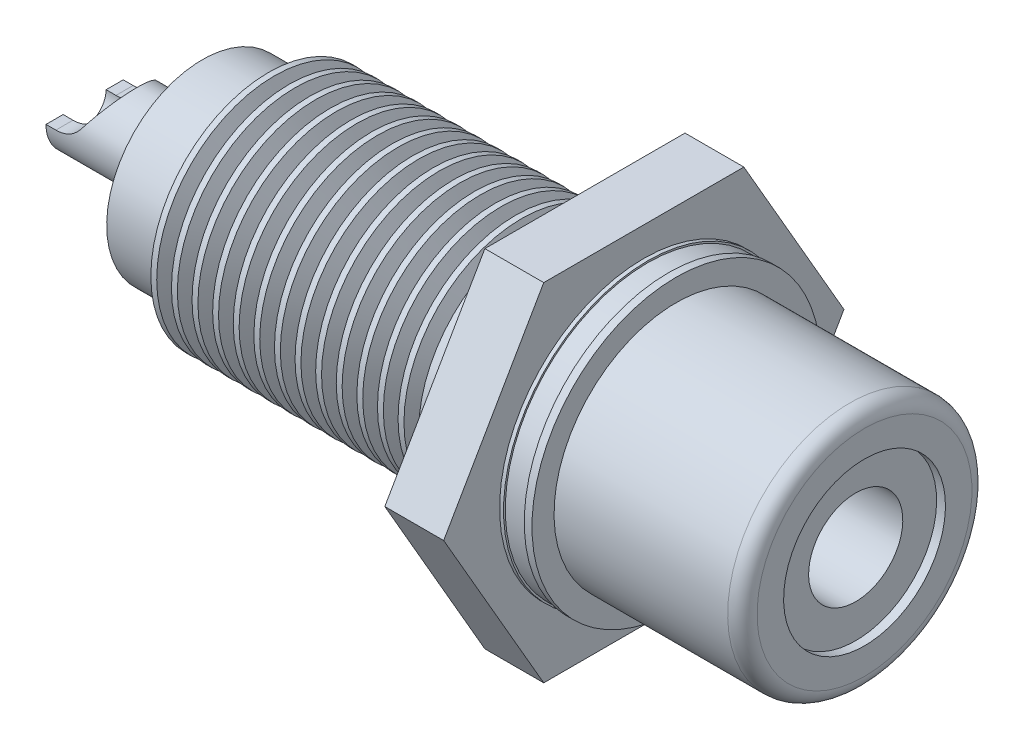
ISO-10303-21;
HEADER;
FILE_DESCRIPTION(('STEP AP214'),'2;1');
FILE_NAME('part.step','',(''),(''),'','','');
FILE_SCHEMA(('AUTOMOTIVE_DESIGN { 1 0 10303 214 1 1 1 1 }'));
ENDSEC;
DATA;
#1=APPLICATION_CONTEXT('core data for automotive mechanical design processes');
#2=APPLICATION_PROTOCOL_DEFINITION('international standard','automotive_design',2000,#1);
#3=PRODUCT_CONTEXT('',#1,'mechanical');
#4=PRODUCT('Part','Part','',(#3));
#5=PRODUCT_RELATED_PRODUCT_CATEGORY('part','',(#4));
#6=PRODUCT_DEFINITION_FORMATION('','',#4);
#7=PRODUCT_DEFINITION_CONTEXT('part definition',#1,'design');
#8=PRODUCT_DEFINITION('design','',#6,#7);
#9=PRODUCT_DEFINITION_SHAPE('','',#8);
#10=(LENGTH_UNIT() NAMED_UNIT(*) SI_UNIT(.MILLI.,.METRE.));
#11=(NAMED_UNIT(*) PLANE_ANGLE_UNIT() SI_UNIT($,.RADIAN.));
#12=(NAMED_UNIT(*) SI_UNIT($,.STERADIAN.) SOLID_ANGLE_UNIT());
#13=UNCERTAINTY_MEASURE_WITH_UNIT(LENGTH_MEASURE(1.E-05),#10,'distance_accuracy_value','');
#14=(GEOMETRIC_REPRESENTATION_CONTEXT(3) GLOBAL_UNCERTAINTY_ASSIGNED_CONTEXT((#13)) GLOBAL_UNIT_ASSIGNED_CONTEXT((#10,
#11,#12)) REPRESENTATION_CONTEXT('',''));
#15=CARTESIAN_POINT('',(0.,0.,0.));
#16=DIRECTION('',(0.,0.,1.));
#17=DIRECTION('',(1.,0.,0.));
#18=AXIS2_PLACEMENT_3D('',#15,#16,#17);
#19=CARTESIAN_POINT('',(-25.002817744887,1.,-5.5));
#20=DIRECTION('',(0.,0.,1.));
#21=DIRECTION('',(1.,0.,0.));
#22=AXIS2_PLACEMENT_3D('',#19,#20,#21);
#23=CYLINDRICAL_SURFACE('',#22,0.999999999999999);
#24=DIRECTION('',(0.,0.,1.));
#25=VECTOR('',#24,1.);
#26=CARTESIAN_POINT('',(-24.1826227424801,0.427915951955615,-5.5));
#27=LINE('',#26,#25);
#28=CARTESIAN_POINT('',(-24.1826227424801,0.427915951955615,0.591691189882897));
#29=VERTEX_POINT('',#28);
#30=CARTESIAN_POINT('',(-24.1826227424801,0.427915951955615,1.24009858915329));
#31=VERTEX_POINT('',#30);
#32=EDGE_CURVE('E224',#29,#31,#27,.T.);
#33=ORIENTED_EDGE('',*,*,#32,.F.);
#34=CARTESIAN_POINT('',(-24.1826227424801,0.427915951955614,0.591691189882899));
#35=CARTESIAN_POINT('',(-24.1927779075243,0.413350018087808,0.602229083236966));
#36=CARTESIAN_POINT('',(-24.2035776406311,0.398701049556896,0.612000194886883));
#37=CARTESIAN_POINT('',(-24.2264168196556,0.369489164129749,0.630064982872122));
#38=CARTESIAN_POINT('',(-24.2384548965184,0.35492617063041,0.638360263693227));
#39=CARTESIAN_POINT('',(-24.2761467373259,0.311970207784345,0.661003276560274));
#40=CARTESIAN_POINT('',(-24.3035734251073,0.284023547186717,0.673306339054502));
#41=CARTESIAN_POINT('',(-24.3623263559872,0.231015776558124,0.693286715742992));
#42=CARTESIAN_POINT('',(-24.3936393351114,0.205945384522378,0.700979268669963));
#43=CARTESIAN_POINT('',(-24.459547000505,0.159471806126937,0.71299116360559));
#44=CARTESIAN_POINT('',(-24.4941489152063,0.13807700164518,0.717302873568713));
#45=CARTESIAN_POINT('',(-24.5710546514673,0.0968103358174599,0.724112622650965));
#46=CARTESIAN_POINT('',(-24.6137478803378,0.07760867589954,0.726257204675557));
#47=CARTESIAN_POINT('',(-24.7014286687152,0.0453547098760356,0.728982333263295));
#48=CARTESIAN_POINT('',(-24.7464160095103,0.0323018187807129,0.729563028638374));
#49=CARTESIAN_POINT('',(-24.8267070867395,0.0149922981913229,0.730097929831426));
#50=CARTESIAN_POINT('',(-24.8617229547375,0.00937208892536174,0.730169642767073));
#51=CARTESIAN_POINT('',(-24.9320958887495,0.00187611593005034,0.730212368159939));
#52=CARTESIAN_POINT('',(-24.9674523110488,-5.69149500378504E-06,0.730183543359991));
#53=CARTESIAN_POINT('',(-25.002817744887,0.,0.730212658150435));
#54=B_SPLINE_CURVE_WITH_KNOTS('',3,(#34,#35,#36,#37,#38,#39,#40,#41,#42,#43,#44,#45,#46,#47,#48,
#49,#50,#51,#52,#53),.UNSPECIFIED.,.F.,.F.,(4,2,2,2,2,2,2,2,2,4),(0.,0.0618925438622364,
0.123717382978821,0.246186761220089,0.368249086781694,0.490586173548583,0.630654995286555,
0.770710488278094,0.876911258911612,0.98294019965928),.UNSPECIFIED.);
#55=CARTESIAN_POINT('',(-25.002817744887,0.,0.730212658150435));
#56=VERTEX_POINT('',#55);
#57=EDGE_CURVE('E212',#29,#56,#54,.T.);
#58=ORIENTED_EDGE('',*,*,#57,.T.);
#59=DIRECTION('',(0.,0.,1.));
#60=VECTOR('',#59,1.);
#61=CARTESIAN_POINT('',(-25.002817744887,0.,-5.5));
#62=LINE('',#61,#60);
#63=CARTESIAN_POINT('',(-25.002817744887,0.,1.31185234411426));
#64=VERTEX_POINT('',#63);
#65=EDGE_CURVE('E160',#56,#64,#62,.T.);
#66=ORIENTED_EDGE('',*,*,#65,.T.);
#67=CARTESIAN_POINT('',(-24.1826227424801,0.427915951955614,1.24009858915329));
#68=CARTESIAN_POINT('',(-24.1969482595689,0.407371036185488,1.24719001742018));
#69=CARTESIAN_POINT('',(-24.2121575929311,0.3872182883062,1.25357051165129));
#70=CARTESIAN_POINT('',(-24.2442451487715,0.34791891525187,1.26504013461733));
#71=CARTESIAN_POINT('',(-24.2611223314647,0.328771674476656,1.27013006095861));
#72=CARTESIAN_POINT('',(-24.3139135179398,0.273366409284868,1.28361438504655));
#73=CARTESIAN_POINT('',(-24.3521698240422,0.238881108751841,1.29030910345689));
#74=CARTESIAN_POINT('',(-24.4337181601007,0.176121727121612,1.30036627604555));
#75=CARTESIAN_POINT('',(-24.4770030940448,0.147839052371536,1.30373336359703));
#76=CARTESIAN_POINT('',(-24.5675636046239,0.0982091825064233,1.30840877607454));
#77=CARTESIAN_POINT('',(-24.6148461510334,0.0768744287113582,1.30971342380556));
#78=CARTESIAN_POINT('',(-24.7177860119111,0.039750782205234,1.31139901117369));
#79=CARTESIAN_POINT('',(-24.7737815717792,0.0248798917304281,1.31165669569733));
#80=CARTESIAN_POINT('',(-24.8590064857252,0.00997216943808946,1.3118225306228));
#81=CARTESIAN_POINT('',(-24.8876374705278,0.00623601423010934,1.31184097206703));
#82=CARTESIAN_POINT('',(-24.9451130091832,0.00125030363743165,1.31185303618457));
#83=CARTESIAN_POINT('',(-24.9739575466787,5.59740194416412E-07,1.31184666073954));
#84=CARTESIAN_POINT('',(-25.002817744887,0.,1.31185234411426));
#85=B_SPLINE_CURVE_WITH_KNOTS('',3,(#67,#68,#69,#70,#71,#72,#73,#74,#75,#76,#77,#78,#79,#80,#81,
#82,#83,#84),.UNSPECIFIED.,.F.,.F.,(4,2,2,2,2,2,2,2,4),(0.,0.0780344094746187,0.156020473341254,
0.31101050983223,0.465784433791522,0.620833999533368,0.793685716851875,0.880214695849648,
0.966737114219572),.UNSPECIFIED.);
#86=EDGE_CURVE('E198',#31,#64,#85,.T.);
#87=ORIENTED_EDGE('',*,*,#86,.F.);
#88=EDGE_LOOP('',(#33,#58,#66,#87));
#89=FACE_BOUND('',#88,.T.);
#90=ADVANCED_FACE('F61',(#89),#23,.F.);
#91=CARTESIAN_POINT('',(-25.3380053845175,0.,-5.5));
#92=DIRECTION('',(0.,-1.,0.));
#93=DIRECTION('',(1.,0.,0.));
#94=AXIS2_PLACEMENT_3D('',#91,#92,#93);
#95=PLANE('',#94);
#96=ORIENTED_EDGE('',*,*,#65,.F.);
#97=DIRECTION('',(-1.,0.,0.));
#98=VECTOR('',#97,1.);
#99=CARTESIAN_POINT('',(-14.3380053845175,0.,0.730212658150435));
#100=LINE('',#99,#98);
#101=CARTESIAN_POINT('',(-25.3380053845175,0.,0.730212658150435));
#102=VERTEX_POINT('',#101);
#103=EDGE_CURVE('E12',#56,#102,#100,.T.);
#104=ORIENTED_EDGE('',*,*,#103,.T.);
#105=DIRECTION('',(0.,0.,-1.));
#106=VECTOR('',#105,1.);
#107=CARTESIAN_POINT('',(-25.3380053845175,0.,0.));
#108=LINE('',#107,#106);
#109=CARTESIAN_POINT('',(-25.3380053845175,0.,1.31185234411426));
#110=VERTEX_POINT('',#109);
#111=EDGE_CURVE('E158',#110,#102,#108,.T.);
#112=ORIENTED_EDGE('',*,*,#111,.F.);
#113=DIRECTION('',(-1.,0.,0.));
#114=VECTOR('',#113,1.);
#115=CARTESIAN_POINT('',(-21.3380053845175,0.,1.31185234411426));
#116=LINE('',#115,#114);
#117=EDGE_CURVE('E230',#64,#110,#116,.T.);
#118=ORIENTED_EDGE('',*,*,#117,.F.);
#119=EDGE_LOOP('',(#96,#104,#112,#118));
#120=FACE_BOUND('',#119,.T.);
#121=ADVANCED_FACE('F156',(#120),#95,.F.);
#122=CARTESIAN_POINT('',(-6.33800538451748,-22.3315477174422,0.));
#123=DIRECTION('',(1.,0.,0.));
#124=DIRECTION('',(0.,1.,0.));
#125=AXIS2_PLACEMENT_3D('',#122,#123,#124);
#126=PLANE('',#125);
#127=CARTESIAN_POINT('',(-6.33800538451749,0.,0.));
#128=DIRECTION('',(-1.,0.,0.));
#129=DIRECTION('',(0.,-1.,0.));
#130=AXIS2_PLACEMENT_3D('',#127,#128,#129);
#131=CIRCLE('',#130,4.9);
#132=CARTESIAN_POINT('',(-6.33800538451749,-4.9,0.));
#133=VERTEX_POINT('',#132);
#134=EDGE_CURVE('E426',#133,#133,#131,.T.);
#135=ORIENTED_EDGE('',*,*,#134,.T.);
#136=EDGE_LOOP('',(#135));
#137=FACE_BOUND('',#136,.T.);
#138=DIRECTION('',(0.,0.866025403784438,0.500000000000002));
#139=VECTOR('',#138,1.);
#140=CARTESIAN_POINT('',(-6.33800538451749,-3.59462089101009,-8.87535533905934));
#141=LINE('',#140,#139);
#142=CARTESIAN_POINT('',(-6.33800538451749,0.,-6.8));
#143=VERTEX_POINT('',#142);
#144=CARTESIAN_POINT('',(-6.33800538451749,5.8889727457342,-3.39999999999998));
#145=VERTEX_POINT('',#144);
#146=EDGE_CURVE('E246',#143,#145,#141,.T.);
#147=ORIENTED_EDGE('',*,*,#146,.T.);
#148=DIRECTION('',(0.,0.,1.));
#149=VECTOR('',#148,1.);
#150=CARTESIAN_POINT('',(-6.33800538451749,5.88897274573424,-15.1014213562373));
#151=LINE('',#150,#149);
#152=CARTESIAN_POINT('',(-6.33800538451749,5.88897274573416,3.40000000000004));
#153=VERTEX_POINT('',#152);
#154=EDGE_CURVE('E241',#145,#153,#151,.T.);
#155=ORIENTED_EDGE('',*,*,#154,.T.);
#156=DIRECTION('',(0.,-0.866025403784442,0.499999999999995));
#157=VECTOR('',#156,1.);
#158=CARTESIAN_POINT('',(-6.33800538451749,9.48359363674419,1.32464466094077));
#159=LINE('',#158,#157);
#160=CARTESIAN_POINT('',(-6.33800538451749,0.,6.8));
#161=VERTEX_POINT('',#160);
#162=EDGE_CURVE('E282',#153,#161,#159,.T.);
#163=ORIENTED_EDGE('',*,*,#162,.T.);
#164=DIRECTION('',(0.,-0.866025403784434,-0.500000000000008));
#165=VECTOR('',#164,1.);
#166=CARTESIAN_POINT('',(-6.33800538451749,-9.48359363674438,1.32464466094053));
#167=LINE('',#166,#165);
#168=CARTESIAN_POINT('',(-6.33800538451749,-5.88897274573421,3.39999999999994));
#169=VERTEX_POINT('',#168);
#170=EDGE_CURVE('E273',#161,#169,#167,.T.);
#171=ORIENTED_EDGE('',*,*,#170,.T.);
#172=DIRECTION('',(0.,0.,-1.));
#173=VECTOR('',#172,1.);
#174=CARTESIAN_POINT('',(-6.33800538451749,-5.88897274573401,-15.1014213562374));
#175=LINE('',#174,#173);
#176=CARTESIAN_POINT('',(-6.33800538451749,-5.88897274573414,-3.40000000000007));
#177=VERTEX_POINT('',#176);
#178=EDGE_CURVE('E264',#169,#177,#175,.T.);
#179=ORIENTED_EDGE('',*,*,#178,.T.);
#180=DIRECTION('',(0.,0.866025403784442,-0.499999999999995));
#181=VECTOR('',#180,1.);
#182=CARTESIAN_POINT('',(-6.33800538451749,3.59462089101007,-8.87535533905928));
#183=LINE('',#182,#181);
#184=EDGE_CURVE('E255',#177,#143,#183,.T.);
#185=ORIENTED_EDGE('',*,*,#184,.T.);
#186=EDGE_LOOP('',(#147,#155,#163,#171,#179,#185));
#187=FACE_BOUND('',#186,.T.);
#188=ADVANCED_FACE('F468',(#137,#187),#126,.T.);
#189=CARTESIAN_POINT('',(-8.33800538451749,-22.3315477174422,0.));
#190=DIRECTION('',(1.,0.,0.));
#191=DIRECTION('',(0.,1.,0.));
#192=AXIS2_PLACEMENT_3D('',#189,#190,#191);
#193=PLANE('',#192);
#194=CARTESIAN_POINT('',(-8.33800538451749,0.,0.));
#195=DIRECTION('',(-1.,0.,0.));
#196=DIRECTION('',(0.,-1.,0.));
#197=AXIS2_PLACEMENT_3D('',#194,#195,#196);
#198=CIRCLE('',#197,4.);
#199=CARTESIAN_POINT('',(-8.33800538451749,-4.,0.));
#200=VERTEX_POINT('',#199);
#201=EDGE_CURVE('E423',#200,#200,#198,.T.);
#202=ORIENTED_EDGE('',*,*,#201,.F.);
#203=EDGE_LOOP('',(#202));
#204=FACE_BOUND('',#203,.T.);
#205=DIRECTION('',(0.,0.,1.));
#206=VECTOR('',#205,1.);
#207=CARTESIAN_POINT('',(-8.33800538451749,5.88897274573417,1.15187763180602E-13));
#208=LINE('',#207,#206);
#209=CARTESIAN_POINT('',(-8.33800538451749,5.8889727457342,-3.39999999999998));
#210=VERTEX_POINT('',#209);
#211=CARTESIAN_POINT('',(-8.33800538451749,5.88897274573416,3.40000000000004));
#212=VERTEX_POINT('',#211);
#213=EDGE_CURVE('E244',#210,#212,#208,.T.);
#214=ORIENTED_EDGE('',*,*,#213,.F.);
#215=DIRECTION('',(0.,0.866025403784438,0.500000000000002));
#216=VECTOR('',#215,1.);
#217=CARTESIAN_POINT('',(-8.33800538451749,-13.8041744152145,-14.7698438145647));
#218=LINE('',#217,#216);
#219=CARTESIAN_POINT('',(-8.33800538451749,0.,-6.8));
#220=VERTEX_POINT('',#219);
#221=EDGE_CURVE('E250',#220,#210,#218,.T.);
#222=ORIENTED_EDGE('',*,*,#221,.F.);
#223=DIRECTION('',(0.,0.866025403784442,-0.499999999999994));
#224=VECTOR('',#223,1.);
#225=CARTESIAN_POINT('',(-8.33800538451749,-19.6931471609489,4.56984381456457));
#226=LINE('',#225,#224);
#227=CARTESIAN_POINT('',(-8.33800538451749,-5.88897274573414,-3.40000000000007));
#228=VERTEX_POINT('',#227);
#229=EDGE_CURVE('E259',#228,#220,#226,.T.);
#230=ORIENTED_EDGE('',*,*,#229,.F.);
#231=DIRECTION('',(0.,0.,-1.));
#232=VECTOR('',#231,1.);
#233=CARTESIAN_POINT('',(-8.33800538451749,-5.88897274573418,1.80368058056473E-13));
#234=LINE('',#233,#232);
#235=CARTESIAN_POINT('',(-8.33800538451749,-5.88897274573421,3.39999999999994));
#236=VERTEX_POINT('',#235);
#237=EDGE_CURVE('E268',#236,#228,#234,.T.);
#238=ORIENTED_EDGE('',*,*,#237,.F.);
#239=DIRECTION('',(0.,-0.866025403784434,-0.500000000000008));
#240=VECTOR('',#239,1.);
#241=CARTESIAN_POINT('',(-8.33800538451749,-19.6931471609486,-4.5698438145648));
#242=LINE('',#241,#240);
#243=CARTESIAN_POINT('',(-8.33800538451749,0.,6.8));
#244=VERTEX_POINT('',#243);
#245=EDGE_CURVE('E277',#244,#236,#242,.T.);
#246=ORIENTED_EDGE('',*,*,#245,.F.);
#247=DIRECTION('',(0.,-0.866025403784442,0.499999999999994));
#248=VECTOR('',#247,1.);
#249=CARTESIAN_POINT('',(-8.33800538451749,-13.8041744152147,14.7698438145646));
#250=LINE('',#249,#248);
#251=EDGE_CURVE('E169',#212,#244,#250,.T.);
#252=ORIENTED_EDGE('',*,*,#251,.F.);
#253=EDGE_LOOP('',(#214,#222,#230,#238,#246,#252));
#254=FACE_BOUND('',#253,.T.);
#255=ADVANCED_FACE('F461',(#204,#254),#193,.F.);
#256=CARTESIAN_POINT('',(1.16199461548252,-22.3315477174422,0.));
#257=DIRECTION('',(-1.,0.,0.));
#258=DIRECTION('',(0.,-1.,0.));
#259=AXIS2_PLACEMENT_3D('',#256,#257,#258);
#260=PLANE('',#259);
#261=CARTESIAN_POINT('',(1.16199461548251,0.,0.));
#262=DIRECTION('',(1.,0.,0.));
#263=DIRECTION('',(0.,1.,0.));
#264=AXIS2_PLACEMENT_3D('',#261,#262,#263);
#265=CIRCLE('',#264,2.75);
#266=CARTESIAN_POINT('',(1.16199461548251,2.75,0.));
#267=VERTEX_POINT('',#266);
#268=EDGE_CURVE('E232',#267,#267,#265,.T.);
#269=ORIENTED_EDGE('',*,*,#268,.F.);
#270=EDGE_LOOP('',(#269));
#271=FACE_BOUND('',#270,.T.);
#272=CARTESIAN_POINT('',(1.16199461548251,0.,0.));
#273=DIRECTION('',(-1.,0.,0.));
#274=DIRECTION('',(0.,-1.,0.));
#275=AXIS2_PLACEMENT_3D('',#272,#273,#274);
#276=CIRCLE('',#275,3.65);
#277=CARTESIAN_POINT('',(1.16199461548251,-3.64999999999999,0.));
#278=VERTEX_POINT('',#277);
#279=EDGE_CURVE('E450',#278,#278,#276,.T.);
#280=ORIENTED_EDGE('',*,*,#279,.F.);
#281=EDGE_LOOP('',(#280));
#282=FACE_BOUND('',#281,.T.);
#283=ADVANCED_FACE('F63',(#271,#282),#260,.F.);
#284=CARTESIAN_POINT('',(0.661994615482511,0.,0.));
#285=DIRECTION('',(-1.,0.,0.));
#286=DIRECTION('',(0.,-1.,0.));
#287=AXIS2_PLACEMENT_3D('',#284,#285,#286);
#288=TOROIDAL_SURFACE('',#287,3.65,0.5);
#289=CARTESIAN_POINT('',(0.661994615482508,0.,0.));
#290=DIRECTION('',(-1.,0.,0.));
#291=DIRECTION('',(0.,-1.,0.));
#292=AXIS2_PLACEMENT_3D('',#289,#290,#291);
#293=CIRCLE('',#292,4.15);
#294=CARTESIAN_POINT('',(0.661994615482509,-4.14999999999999,0.));
#295=VERTEX_POINT('',#294);
#296=EDGE_CURVE('E447',#295,#295,#293,.T.);
#297=ORIENTED_EDGE('',*,*,#296,.F.);
#298=EDGE_LOOP('',(#297));
#299=FACE_BOUND('',#298,.T.);
#300=ORIENTED_EDGE('',*,*,#279,.T.);
#301=EDGE_LOOP('',(#300));
#302=FACE_BOUND('',#301,.T.);
#303=ADVANCED_FACE('F1165',(#299,#302),#288,.T.);
#304=CARTESIAN_POINT('',(-21.3380053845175,0.,0.));
#305=DIRECTION('',(-1.,0.,0.));
#306=DIRECTION('',(0.,-1.,0.));
#307=AXIS2_PLACEMENT_3D('',#304,#305,#306);
#308=CYLINDRICAL_SURFACE('',#307,4.15);
#309=CARTESIAN_POINT('',(-5.23800538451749,0.,0.));
#310=DIRECTION('',(-1.,0.,0.));
#311=DIRECTION('',(0.,-1.,0.));
#312=AXIS2_PLACEMENT_3D('',#309,#310,#311);
#313=CIRCLE('',#312,4.15);
#314=CARTESIAN_POINT('',(-5.23800538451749,-4.15,0.));
#315=VERTEX_POINT('',#314);
#316=EDGE_CURVE('E444',#315,#315,#313,.T.);
#317=ORIENTED_EDGE('',*,*,#316,.F.);
#318=EDGE_LOOP('',(#317));
#319=FACE_BOUND('',#318,.T.);
#320=ORIENTED_EDGE('',*,*,#296,.T.);
#321=EDGE_LOOP('',(#320));
#322=FACE_BOUND('',#321,.T.);
#323=ADVANCED_FACE('F1155',(#319,#322),#308,.T.);
#324=CARTESIAN_POINT('',(-5.23800538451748,-22.3315477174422,0.));
#325=DIRECTION('',(-1.,0.,0.));
#326=DIRECTION('',(0.,-1.,0.));
#327=AXIS2_PLACEMENT_3D('',#324,#325,#326);
#328=PLANE('',#327);
#329=CARTESIAN_POINT('',(-5.23800538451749,0.,0.));
#330=DIRECTION('',(-1.,0.,0.));
#331=DIRECTION('',(0.,-1.,0.));
#332=AXIS2_PLACEMENT_3D('',#329,#330,#331);
#333=CIRCLE('',#332,4.9);
#334=CARTESIAN_POINT('',(-5.23800538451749,-4.89999999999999,0.));
#335=VERTEX_POINT('',#334);
#336=EDGE_CURVE('E441',#335,#335,#333,.T.);
#337=ORIENTED_EDGE('',*,*,#336,.F.);
#338=EDGE_LOOP('',(#337));
#339=FACE_BOUND('',#338,.T.);
#340=ORIENTED_EDGE('',*,*,#316,.T.);
#341=EDGE_LOOP('',(#340));
#342=FACE_BOUND('',#341,.T.);
#343=ADVANCED_FACE('F1145',(#339,#342),#328,.F.);
#344=CARTESIAN_POINT('',(-21.3380053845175,0.,0.));
#345=DIRECTION('',(-1.,0.,0.));
#346=DIRECTION('',(0.,-1.,0.));
#347=AXIS2_PLACEMENT_3D('',#344,#345,#346);
#348=CYLINDRICAL_SURFACE('',#347,4.9);
#349=CARTESIAN_POINT('',(-5.50016858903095,0.,0.));
#350=DIRECTION('',(-1.,0.,0.));
#351=DIRECTION('',(0.,-1.,0.));
#352=AXIS2_PLACEMENT_3D('',#349,#350,#351);
#353=CIRCLE('',#352,4.9);
#354=CARTESIAN_POINT('',(-5.50016858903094,-4.9,0.));
#355=VERTEX_POINT('',#354);
#356=EDGE_CURVE('E438',#355,#355,#353,.T.);
#357=ORIENTED_EDGE('',*,*,#356,.F.);
#358=EDGE_LOOP('',(#357));
#359=FACE_BOUND('',#358,.T.);
#360=ORIENTED_EDGE('',*,*,#336,.T.);
#361=EDGE_LOOP('',(#360));
#362=FACE_BOUND('',#361,.T.);
#363=ADVANCED_FACE('F1135',(#359,#362),#348,.T.);
#364=CARTESIAN_POINT('',(-5.50016858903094,-22.3315477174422,0.));
#365=DIRECTION('',(-1.,0.,0.));
#366=DIRECTION('',(0.,-1.,0.));
#367=AXIS2_PLACEMENT_3D('',#364,#365,#366);
#368=PLANE('',#367);
#369=ORIENTED_EDGE('',*,*,#356,.T.);
#370=EDGE_LOOP('',(#369));
#371=FACE_BOUND('',#370,.T.);
#372=CARTESIAN_POINT('',(-5.50016858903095,0.,0.));
#373=DIRECTION('',(-1.,0.,0.));
#374=DIRECTION('',(0.,-1.,0.));
#375=AXIS2_PLACEMENT_3D('',#372,#373,#374);
#376=CIRCLE('',#375,4.84134962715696);
#377=CARTESIAN_POINT('',(-5.50016858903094,-4.84134962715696,0.));
#378=VERTEX_POINT('',#377);
#379=EDGE_CURVE('E435',#378,#378,#376,.T.);
#380=ORIENTED_EDGE('',*,*,#379,.F.);
#381=EDGE_LOOP('',(#380));
#382=FACE_BOUND('',#381,.T.);
#383=ADVANCED_FACE('F1125',(#371,#382),#368,.T.);
#384=CARTESIAN_POINT('',(-21.3380053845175,0.,0.));
#385=DIRECTION('',(-1.,0.,0.));
#386=DIRECTION('',(0.,-1.,0.));
#387=AXIS2_PLACEMENT_3D('',#384,#385,#386);
#388=CYLINDRICAL_SURFACE('',#387,4.84134962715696);
#389=ORIENTED_EDGE('',*,*,#379,.T.);
#390=EDGE_LOOP('',(#389));
#391=FACE_BOUND('',#390,.T.);
#392=CARTESIAN_POINT('',(-6.20384829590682,0.,0.));
#393=DIRECTION('',(-1.,0.,0.));
#394=DIRECTION('',(0.,-1.,0.));
#395=AXIS2_PLACEMENT_3D('',#392,#393,#394);
#396=CIRCLE('',#395,4.84134962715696);
#397=CARTESIAN_POINT('',(-6.20384829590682,-4.84134962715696,0.));
#398=VERTEX_POINT('',#397);
#399=EDGE_CURVE('E432',#398,#398,#396,.T.);
#400=ORIENTED_EDGE('',*,*,#399,.F.);
#401=EDGE_LOOP('',(#400));
#402=FACE_BOUND('',#401,.T.);
#403=ADVANCED_FACE('F1114',(#391,#402),#388,.T.);
#404=CARTESIAN_POINT('',(-6.20384829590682,-22.3315477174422,0.));
#405=DIRECTION('',(1.,0.,0.));
#406=DIRECTION('',(0.,1.,0.));
#407=AXIS2_PLACEMENT_3D('',#404,#405,#406);
#408=PLANE('',#407);
#409=ORIENTED_EDGE('',*,*,#399,.T.);
#410=EDGE_LOOP('',(#409));
#411=FACE_BOUND('',#410,.T.);
#412=CARTESIAN_POINT('',(-6.20384829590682,0.,0.));
#413=DIRECTION('',(-1.,0.,0.));
#414=DIRECTION('',(0.,-1.,0.));
#415=AXIS2_PLACEMENT_3D('',#412,#413,#414);
#416=CIRCLE('',#415,4.9);
#417=CARTESIAN_POINT('',(-6.20384829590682,-4.9,0.));
#418=VERTEX_POINT('',#417);
#419=EDGE_CURVE('E429',#418,#418,#416,.T.);
#420=ORIENTED_EDGE('',*,*,#419,.F.);
#421=EDGE_LOOP('',(#420));
#422=FACE_BOUND('',#421,.T.);
#423=ADVANCED_FACE('F1103',(#411,#422),#408,.T.);
#424=CARTESIAN_POINT('',(-21.3380053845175,0.,0.));
#425=DIRECTION('',(-1.,0.,0.));
#426=DIRECTION('',(0.,-1.,0.));
#427=AXIS2_PLACEMENT_3D('',#424,#425,#426);
#428=CYLINDRICAL_SURFACE('',#427,4.9);
#429=ORIENTED_EDGE('',*,*,#134,.F.);
#430=EDGE_LOOP('',(#429));
#431=FACE_BOUND('',#430,.T.);
#432=ORIENTED_EDGE('',*,*,#419,.T.);
#433=EDGE_LOOP('',(#432));
#434=FACE_BOUND('',#433,.T.);
#435=ADVANCED_FACE('F1092',(#431,#434),#428,.T.);
#436=CARTESIAN_POINT('',(-21.3380053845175,0.,0.));
#437=DIRECTION('',(-1.,0.,0.));
#438=DIRECTION('',(0.,-1.,0.));
#439=AXIS2_PLACEMENT_3D('',#436,#437,#438);
#440=CYLINDRICAL_SURFACE('',#439,4.);
#441=CARTESIAN_POINT('',(-9.98800538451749,0.,0.));
#442=DIRECTION('',(-1.,0.,0.));
#443=DIRECTION('',(0.,-1.,0.));
#444=AXIS2_PLACEMENT_3D('',#441,#442,#443);
#445=CIRCLE('',#444,4.);
#446=CARTESIAN_POINT('',(-9.98800538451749,-4.,0.));
#447=VERTEX_POINT('',#446);
#448=EDGE_CURVE('E420',#447,#447,#445,.T.);
#449=ORIENTED_EDGE('',*,*,#448,.F.);
#450=EDGE_LOOP('',(#449));
#451=FACE_BOUND('',#450,.T.);
#452=ORIENTED_EDGE('',*,*,#201,.T.);
#453=EDGE_LOOP('',(#452));
#454=FACE_BOUND('',#453,.T.);
#455=ADVANCED_FACE('F1082',(#451,#454),#440,.T.);
#456=CARTESIAN_POINT('',(-10.2380053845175,0.,0.));
#457=DIRECTION('',(1.,0.,0.));
#458=DIRECTION('',(0.,1.,0.));
#459=AXIS2_PLACEMENT_3D('',#456,#457,#458);
#460=CONICAL_SURFACE('',#459,3.5,1.10714871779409);
#461=ORIENTED_EDGE('',*,*,#448,.T.);
#462=EDGE_LOOP('',(#461));
#463=FACE_BOUND('',#462,.T.);
#464=CARTESIAN_POINT('',(-10.2380053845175,0.,0.));
#465=DIRECTION('',(-1.,0.,0.));
#466=DIRECTION('',(0.,-1.,0.));
#467=AXIS2_PLACEMENT_3D('',#464,#465,#466);
#468=CIRCLE('',#467,3.5);
#469=CARTESIAN_POINT('',(-10.2380053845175,-3.5,0.));
#470=VERTEX_POINT('',#469);
#471=EDGE_CURVE('E417',#470,#470,#468,.T.);
#472=ORIENTED_EDGE('',*,*,#471,.F.);
#473=EDGE_LOOP('',(#472));
#474=FACE_BOUND('',#473,.T.);
#475=ADVANCED_FACE('F1071',(#463,#474),#460,.T.);
#476=CARTESIAN_POINT('',(-10.4880053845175,0.,0.));
#477=DIRECTION('',(-1.,0.,0.));
#478=DIRECTION('',(0.,-1.,0.));
#479=AXIS2_PLACEMENT_3D('',#476,#477,#478);
#480=CONICAL_SURFACE('',#479,4.,1.10714871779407);
#481=ORIENTED_EDGE('',*,*,#471,.T.);
#482=EDGE_LOOP('',(#481));
#483=FACE_BOUND('',#482,.T.);
#484=CARTESIAN_POINT('',(-10.4880053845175,0.,0.));
#485=DIRECTION('',(-1.,0.,0.));
#486=DIRECTION('',(0.,-1.,0.));
#487=AXIS2_PLACEMENT_3D('',#484,#485,#486);
#488=CIRCLE('',#487,4.);
#489=CARTESIAN_POINT('',(-10.4880053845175,-4.,0.));
#490=VERTEX_POINT('',#489);
#491=EDGE_CURVE('E414',#490,#490,#488,.T.);
#492=ORIENTED_EDGE('',*,*,#491,.F.);
#493=EDGE_LOOP('',(#492));
#494=FACE_BOUND('',#493,.T.);
#495=ADVANCED_FACE('F1060',(#483,#494),#480,.T.);
#496=CARTESIAN_POINT('',(-21.3380053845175,0.,0.));
#497=DIRECTION('',(-1.,0.,0.));
#498=DIRECTION('',(0.,-1.,0.));
#499=AXIS2_PLACEMENT_3D('',#496,#497,#498);
#500=CYLINDRICAL_SURFACE('',#499,4.);
#501=CARTESIAN_POINT('',(-10.6880053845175,0.,0.));
#502=DIRECTION('',(-1.,0.,0.));
#503=DIRECTION('',(0.,-1.,0.));
#504=AXIS2_PLACEMENT_3D('',#501,#502,#503);
#505=CIRCLE('',#504,4.);
#506=CARTESIAN_POINT('',(-10.6880053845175,-4.,0.));
#507=VERTEX_POINT('',#506);
#508=EDGE_CURVE('E411',#507,#507,#505,.T.);
#509=ORIENTED_EDGE('',*,*,#508,.F.);
#510=EDGE_LOOP('',(#509));
#511=FACE_BOUND('',#510,.T.);
#512=ORIENTED_EDGE('',*,*,#491,.T.);
#513=EDGE_LOOP('',(#512));
#514=FACE_BOUND('',#513,.T.);
#515=ADVANCED_FACE('F1050',(#511,#514),#500,.T.);
#516=CARTESIAN_POINT('',(-10.9380053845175,0.,0.));
#517=DIRECTION('',(1.,0.,0.));
#518=DIRECTION('',(0.,1.,0.));
#519=AXIS2_PLACEMENT_3D('',#516,#517,#518);
#520=CONICAL_SURFACE('',#519,3.5,1.10714871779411);
#521=ORIENTED_EDGE('',*,*,#508,.T.);
#522=EDGE_LOOP('',(#521));
#523=FACE_BOUND('',#522,.T.);
#524=CARTESIAN_POINT('',(-10.9380053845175,0.,0.));
#525=DIRECTION('',(-1.,0.,0.));
#526=DIRECTION('',(0.,-1.,0.));
#527=AXIS2_PLACEMENT_3D('',#524,#525,#526);
#528=CIRCLE('',#527,3.5);
#529=CARTESIAN_POINT('',(-10.9380053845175,-3.5,0.));
#530=VERTEX_POINT('',#529);
#531=EDGE_CURVE('E408',#530,#530,#528,.T.);
#532=ORIENTED_EDGE('',*,*,#531,.F.);
#533=EDGE_LOOP('',(#532));
#534=FACE_BOUND('',#533,.T.);
#535=ADVANCED_FACE('F1039',(#523,#534),#520,.T.);
#536=CARTESIAN_POINT('',(-11.1880053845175,0.,0.));
#537=DIRECTION('',(-1.,0.,0.));
#538=DIRECTION('',(0.,-1.,0.));
#539=AXIS2_PLACEMENT_3D('',#536,#537,#538);
#540=CONICAL_SURFACE('',#539,3.99999999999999,1.10714871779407);
#541=ORIENTED_EDGE('',*,*,#531,.T.);
#542=EDGE_LOOP('',(#541));
#543=FACE_BOUND('',#542,.T.);
#544=CARTESIAN_POINT('',(-11.1880053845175,0.,0.));
#545=DIRECTION('',(-1.,0.,0.));
#546=DIRECTION('',(0.,-1.,0.));
#547=AXIS2_PLACEMENT_3D('',#544,#545,#546);
#548=CIRCLE('',#547,3.99999999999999);
#549=CARTESIAN_POINT('',(-11.1880053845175,-3.99999999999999,0.));
#550=VERTEX_POINT('',#549);
#551=EDGE_CURVE('E405',#550,#550,#548,.T.);
#552=ORIENTED_EDGE('',*,*,#551,.F.);
#553=EDGE_LOOP('',(#552));
#554=FACE_BOUND('',#553,.T.);
#555=ADVANCED_FACE('F1028',(#543,#554),#540,.T.);
#556=CARTESIAN_POINT('',(-21.3380053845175,0.,0.));
#557=DIRECTION('',(-1.,0.,0.));
#558=DIRECTION('',(0.,-1.,0.));
#559=AXIS2_PLACEMENT_3D('',#556,#557,#558);
#560=CYLINDRICAL_SURFACE('',#559,4.);
#561=CARTESIAN_POINT('',(-11.3880053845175,0.,0.));
#562=DIRECTION('',(-1.,0.,0.));
#563=DIRECTION('',(0.,-1.,0.));
#564=AXIS2_PLACEMENT_3D('',#561,#562,#563);
#565=CIRCLE('',#564,4.);
#566=CARTESIAN_POINT('',(-11.3880053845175,-4.,0.));
#567=VERTEX_POINT('',#566);
#568=EDGE_CURVE('E402',#567,#567,#565,.T.);
#569=ORIENTED_EDGE('',*,*,#568,.F.);
#570=EDGE_LOOP('',(#569));
#571=FACE_BOUND('',#570,.T.);
#572=ORIENTED_EDGE('',*,*,#551,.T.);
#573=EDGE_LOOP('',(#572));
#574=FACE_BOUND('',#573,.T.);
#575=ADVANCED_FACE('F1018',(#571,#574),#560,.T.);
#576=CARTESIAN_POINT('',(-11.6380053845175,0.,0.));
#577=DIRECTION('',(1.,0.,0.));
#578=DIRECTION('',(0.,1.,0.));
#579=AXIS2_PLACEMENT_3D('',#576,#577,#578);
#580=CONICAL_SURFACE('',#579,3.5,1.1071487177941);
#581=ORIENTED_EDGE('',*,*,#568,.T.);
#582=EDGE_LOOP('',(#581));
#583=FACE_BOUND('',#582,.T.);
#584=CARTESIAN_POINT('',(-11.6380053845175,0.,0.));
#585=DIRECTION('',(-1.,0.,0.));
#586=DIRECTION('',(0.,-1.,0.));
#587=AXIS2_PLACEMENT_3D('',#584,#585,#586);
#588=CIRCLE('',#587,3.5);
#589=CARTESIAN_POINT('',(-11.6380053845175,-3.5,0.));
#590=VERTEX_POINT('',#589);
#591=EDGE_CURVE('E399',#590,#590,#588,.T.);
#592=ORIENTED_EDGE('',*,*,#591,.F.);
#593=EDGE_LOOP('',(#592));
#594=FACE_BOUND('',#593,.T.);
#595=ADVANCED_FACE('F1007',(#583,#594),#580,.T.);
#596=CARTESIAN_POINT('',(-11.8880053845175,0.,0.));
#597=DIRECTION('',(-1.,0.,0.));
#598=DIRECTION('',(0.,-1.,0.));
#599=AXIS2_PLACEMENT_3D('',#596,#597,#598);
#600=CONICAL_SURFACE('',#599,4.,1.10714871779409);
#601=ORIENTED_EDGE('',*,*,#591,.T.);
#602=EDGE_LOOP('',(#601));
#603=FACE_BOUND('',#602,.T.);
#604=CARTESIAN_POINT('',(-11.8880053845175,0.,0.));
#605=DIRECTION('',(-1.,0.,0.));
#606=DIRECTION('',(0.,-1.,0.));
#607=AXIS2_PLACEMENT_3D('',#604,#605,#606);
#608=CIRCLE('',#607,4.);
#609=CARTESIAN_POINT('',(-11.8880053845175,-4.,0.));
#610=VERTEX_POINT('',#609);
#611=EDGE_CURVE('E396',#610,#610,#608,.T.);
#612=ORIENTED_EDGE('',*,*,#611,.F.);
#613=EDGE_LOOP('',(#612));
#614=FACE_BOUND('',#613,.T.);
#615=ADVANCED_FACE('F996',(#603,#614),#600,.T.);
#616=CARTESIAN_POINT('',(-21.3380053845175,0.,0.));
#617=DIRECTION('',(-1.,0.,0.));
#618=DIRECTION('',(0.,-1.,0.));
#619=AXIS2_PLACEMENT_3D('',#616,#617,#618);
#620=CYLINDRICAL_SURFACE('',#619,4.);
#621=CARTESIAN_POINT('',(-12.0880053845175,0.,0.));
#622=DIRECTION('',(-1.,0.,0.));
#623=DIRECTION('',(0.,-1.,0.));
#624=AXIS2_PLACEMENT_3D('',#621,#622,#623);
#625=CIRCLE('',#624,3.99999999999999);
#626=CARTESIAN_POINT('',(-12.0880053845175,-3.99999999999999,0.));
#627=VERTEX_POINT('',#626);
#628=EDGE_CURVE('E393',#627,#627,#625,.T.);
#629=ORIENTED_EDGE('',*,*,#628,.F.);
#630=EDGE_LOOP('',(#629));
#631=FACE_BOUND('',#630,.T.);
#632=ORIENTED_EDGE('',*,*,#611,.T.);
#633=EDGE_LOOP('',(#632));
#634=FACE_BOUND('',#633,.T.);
#635=ADVANCED_FACE('F986',(#631,#634),#620,.T.);
#636=CARTESIAN_POINT('',(-12.3380053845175,0.,0.));
#637=DIRECTION('',(1.,0.,0.));
#638=DIRECTION('',(0.,1.,0.));
#639=AXIS2_PLACEMENT_3D('',#636,#637,#638);
#640=CONICAL_SURFACE('',#639,3.5,1.1071487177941);
#641=ORIENTED_EDGE('',*,*,#628,.T.);
#642=EDGE_LOOP('',(#641));
#643=FACE_BOUND('',#642,.T.);
#644=CARTESIAN_POINT('',(-12.3380053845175,0.,0.));
#645=DIRECTION('',(-1.,0.,0.));
#646=DIRECTION('',(0.,-1.,0.));
#647=AXIS2_PLACEMENT_3D('',#644,#645,#646);
#648=CIRCLE('',#647,3.5);
#649=CARTESIAN_POINT('',(-12.3380053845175,-3.5,0.));
#650=VERTEX_POINT('',#649);
#651=EDGE_CURVE('E390',#650,#650,#648,.T.);
#652=ORIENTED_EDGE('',*,*,#651,.F.);
#653=EDGE_LOOP('',(#652));
#654=FACE_BOUND('',#653,.T.);
#655=ADVANCED_FACE('F975',(#643,#654),#640,.T.);
#656=CARTESIAN_POINT('',(-12.5880053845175,0.,0.));
#657=DIRECTION('',(-1.,0.,0.));
#658=DIRECTION('',(0.,-1.,0.));
#659=AXIS2_PLACEMENT_3D('',#656,#657,#658);
#660=CONICAL_SURFACE('',#659,4.,1.10714871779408);
#661=ORIENTED_EDGE('',*,*,#651,.T.);
#662=EDGE_LOOP('',(#661));
#663=FACE_BOUND('',#662,.T.);
#664=CARTESIAN_POINT('',(-12.5880053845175,0.,0.));
#665=DIRECTION('',(-1.,0.,0.));
#666=DIRECTION('',(0.,-1.,0.));
#667=AXIS2_PLACEMENT_3D('',#664,#665,#666);
#668=CIRCLE('',#667,4.);
#669=CARTESIAN_POINT('',(-12.5880053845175,-4.,0.));
#670=VERTEX_POINT('',#669);
#671=EDGE_CURVE('E387',#670,#670,#668,.T.);
#672=ORIENTED_EDGE('',*,*,#671,.F.);
#673=EDGE_LOOP('',(#672));
#674=FACE_BOUND('',#673,.T.);
#675=ADVANCED_FACE('F964',(#663,#674),#660,.T.);
#676=CARTESIAN_POINT('',(-21.3380053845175,0.,0.));
#677=DIRECTION('',(-1.,0.,0.));
#678=DIRECTION('',(0.,-1.,0.));
#679=AXIS2_PLACEMENT_3D('',#676,#677,#678);
#680=CYLINDRICAL_SURFACE('',#679,4.);
#681=CARTESIAN_POINT('',(-12.7880053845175,0.,0.));
#682=DIRECTION('',(-1.,0.,0.));
#683=DIRECTION('',(0.,-1.,0.));
#684=AXIS2_PLACEMENT_3D('',#681,#682,#683);
#685=CIRCLE('',#684,3.99999999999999);
#686=CARTESIAN_POINT('',(-12.7880053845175,-3.99999999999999,0.));
#687=VERTEX_POINT('',#686);
#688=EDGE_CURVE('E384',#687,#687,#685,.T.);
#689=ORIENTED_EDGE('',*,*,#688,.F.);
#690=EDGE_LOOP('',(#689));
#691=FACE_BOUND('',#690,.T.);
#692=ORIENTED_EDGE('',*,*,#671,.T.);
#693=EDGE_LOOP('',(#692));
#694=FACE_BOUND('',#693,.T.);
#695=ADVANCED_FACE('F954',(#691,#694),#680,.T.);
#696=CARTESIAN_POINT('',(-13.0380053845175,0.,0.));
#697=DIRECTION('',(1.,0.,0.));
#698=DIRECTION('',(0.,1.,0.));
#699=AXIS2_PLACEMENT_3D('',#696,#697,#698);
#700=CONICAL_SURFACE('',#699,3.5,1.10714871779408);
#701=ORIENTED_EDGE('',*,*,#688,.T.);
#702=EDGE_LOOP('',(#701));
#703=FACE_BOUND('',#702,.T.);
#704=CARTESIAN_POINT('',(-13.0380053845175,0.,0.));
#705=DIRECTION('',(-1.,0.,0.));
#706=DIRECTION('',(0.,-1.,0.));
#707=AXIS2_PLACEMENT_3D('',#704,#705,#706);
#708=CIRCLE('',#707,3.5);
#709=CARTESIAN_POINT('',(-13.0380053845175,-3.5,0.));
#710=VERTEX_POINT('',#709);
#711=EDGE_CURVE('E381',#710,#710,#708,.T.);
#712=ORIENTED_EDGE('',*,*,#711,.F.);
#713=EDGE_LOOP('',(#712));
#714=FACE_BOUND('',#713,.T.);
#715=ADVANCED_FACE('F943',(#703,#714),#700,.T.);
#716=CARTESIAN_POINT('',(-13.2880053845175,0.,0.));
#717=DIRECTION('',(-1.,0.,0.));
#718=DIRECTION('',(0.,-1.,0.));
#719=AXIS2_PLACEMENT_3D('',#716,#717,#718);
#720=CONICAL_SURFACE('',#719,4.,1.10714871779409);
#721=ORIENTED_EDGE('',*,*,#711,.T.);
#722=EDGE_LOOP('',(#721));
#723=FACE_BOUND('',#722,.T.);
#724=CARTESIAN_POINT('',(-13.2880053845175,0.,0.));
#725=DIRECTION('',(-1.,0.,0.));
#726=DIRECTION('',(0.,-1.,0.));
#727=AXIS2_PLACEMENT_3D('',#724,#725,#726);
#728=CIRCLE('',#727,4.);
#729=CARTESIAN_POINT('',(-13.2880053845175,-4.,0.));
#730=VERTEX_POINT('',#729);
#731=EDGE_CURVE('E378',#730,#730,#728,.T.);
#732=ORIENTED_EDGE('',*,*,#731,.F.);
#733=EDGE_LOOP('',(#732));
#734=FACE_BOUND('',#733,.T.);
#735=ADVANCED_FACE('F932',(#723,#734),#720,.T.);
#736=CARTESIAN_POINT('',(-21.3380053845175,0.,0.));
#737=DIRECTION('',(-1.,0.,0.));
#738=DIRECTION('',(0.,-1.,0.));
#739=AXIS2_PLACEMENT_3D('',#736,#737,#738);
#740=CYLINDRICAL_SURFACE('',#739,4.);
#741=CARTESIAN_POINT('',(-13.4880053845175,0.,0.));
#742=DIRECTION('',(-1.,0.,0.));
#743=DIRECTION('',(0.,-1.,0.));
#744=AXIS2_PLACEMENT_3D('',#741,#742,#743);
#745=CIRCLE('',#744,4.);
#746=CARTESIAN_POINT('',(-13.4880053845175,-4.,0.));
#747=VERTEX_POINT('',#746);
#748=EDGE_CURVE('E375',#747,#747,#745,.T.);
#749=ORIENTED_EDGE('',*,*,#748,.F.);
#750=EDGE_LOOP('',(#749));
#751=FACE_BOUND('',#750,.T.);
#752=ORIENTED_EDGE('',*,*,#731,.T.);
#753=EDGE_LOOP('',(#752));
#754=FACE_BOUND('',#753,.T.);
#755=ADVANCED_FACE('F922',(#751,#754),#740,.T.);
#756=CARTESIAN_POINT('',(-13.7380053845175,0.,0.));
#757=DIRECTION('',(1.,0.,0.));
#758=DIRECTION('',(0.,1.,0.));
#759=AXIS2_PLACEMENT_3D('',#756,#757,#758);
#760=CONICAL_SURFACE('',#759,3.5,1.1071487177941);
#761=ORIENTED_EDGE('',*,*,#748,.T.);
#762=EDGE_LOOP('',(#761));
#763=FACE_BOUND('',#762,.T.);
#764=CARTESIAN_POINT('',(-13.7380053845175,0.,0.));
#765=DIRECTION('',(-1.,0.,0.));
#766=DIRECTION('',(0.,-1.,0.));
#767=AXIS2_PLACEMENT_3D('',#764,#765,#766);
#768=CIRCLE('',#767,3.5);
#769=CARTESIAN_POINT('',(-13.7380053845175,-3.5,0.));
#770=VERTEX_POINT('',#769);
#771=EDGE_CURVE('E372',#770,#770,#768,.T.);
#772=ORIENTED_EDGE('',*,*,#771,.F.);
#773=EDGE_LOOP('',(#772));
#774=FACE_BOUND('',#773,.T.);
#775=ADVANCED_FACE('F911',(#763,#774),#760,.T.);
#776=CARTESIAN_POINT('',(-13.9880053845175,0.,0.));
#777=DIRECTION('',(-1.,0.,0.));
#778=DIRECTION('',(0.,-1.,0.));
#779=AXIS2_PLACEMENT_3D('',#776,#777,#778);
#780=CONICAL_SURFACE('',#779,4.,1.10714871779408);
#781=ORIENTED_EDGE('',*,*,#771,.T.);
#782=EDGE_LOOP('',(#781));
#783=FACE_BOUND('',#782,.T.);
#784=CARTESIAN_POINT('',(-13.9880053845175,0.,0.));
#785=DIRECTION('',(-1.,0.,0.));
#786=DIRECTION('',(0.,-1.,0.));
#787=AXIS2_PLACEMENT_3D('',#784,#785,#786);
#788=CIRCLE('',#787,4.);
#789=CARTESIAN_POINT('',(-13.9880053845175,-4.,0.));
#790=VERTEX_POINT('',#789);
#791=EDGE_CURVE('E369',#790,#790,#788,.T.);
#792=ORIENTED_EDGE('',*,*,#791,.F.);
#793=EDGE_LOOP('',(#792));
#794=FACE_BOUND('',#793,.T.);
#795=ADVANCED_FACE('F900',(#783,#794),#780,.T.);
#796=CARTESIAN_POINT('',(-21.3380053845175,0.,0.));
#797=DIRECTION('',(-1.,0.,0.));
#798=DIRECTION('',(0.,-1.,0.));
#799=AXIS2_PLACEMENT_3D('',#796,#797,#798);
#800=CYLINDRICAL_SURFACE('',#799,4.);
#801=CARTESIAN_POINT('',(-14.1880053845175,0.,0.));
#802=DIRECTION('',(-1.,0.,0.));
#803=DIRECTION('',(0.,-1.,0.));
#804=AXIS2_PLACEMENT_3D('',#801,#802,#803);
#805=CIRCLE('',#804,4.);
#806=CARTESIAN_POINT('',(-14.1880053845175,-4.,0.));
#807=VERTEX_POINT('',#806);
#808=EDGE_CURVE('E366',#807,#807,#805,.T.);
#809=ORIENTED_EDGE('',*,*,#808,.F.);
#810=EDGE_LOOP('',(#809));
#811=FACE_BOUND('',#810,.T.);
#812=ORIENTED_EDGE('',*,*,#791,.T.);
#813=EDGE_LOOP('',(#812));
#814=FACE_BOUND('',#813,.T.);
#815=ADVANCED_FACE('F890',(#811,#814),#800,.T.);
#816=CARTESIAN_POINT('',(-14.4380053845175,0.,0.));
#817=DIRECTION('',(1.,0.,0.));
#818=DIRECTION('',(0.,1.,0.));
#819=AXIS2_PLACEMENT_3D('',#816,#817,#818);
#820=CONICAL_SURFACE('',#819,3.5,1.10714871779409);
#821=ORIENTED_EDGE('',*,*,#808,.T.);
#822=EDGE_LOOP('',(#821));
#823=FACE_BOUND('',#822,.T.);
#824=CARTESIAN_POINT('',(-14.4380053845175,0.,0.));
#825=DIRECTION('',(-1.,0.,0.));
#826=DIRECTION('',(0.,-1.,0.));
#827=AXIS2_PLACEMENT_3D('',#824,#825,#826);
#828=CIRCLE('',#827,3.5);
#829=CARTESIAN_POINT('',(-14.4380053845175,-3.5,0.));
#830=VERTEX_POINT('',#829);
#831=EDGE_CURVE('E363',#830,#830,#828,.T.);
#832=ORIENTED_EDGE('',*,*,#831,.F.);
#833=EDGE_LOOP('',(#832));
#834=FACE_BOUND('',#833,.T.);
#835=ADVANCED_FACE('F879',(#823,#834),#820,.T.);
#836=CARTESIAN_POINT('',(-14.6880053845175,0.,0.));
#837=DIRECTION('',(-1.,0.,0.));
#838=DIRECTION('',(0.,-1.,0.));
#839=AXIS2_PLACEMENT_3D('',#836,#837,#838);
#840=CONICAL_SURFACE('',#839,4.,1.10714871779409);
#841=ORIENTED_EDGE('',*,*,#831,.T.);
#842=EDGE_LOOP('',(#841));
#843=FACE_BOUND('',#842,.T.);
#844=CARTESIAN_POINT('',(-14.6880053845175,0.,0.));
#845=DIRECTION('',(-1.,0.,0.));
#846=DIRECTION('',(0.,-1.,0.));
#847=AXIS2_PLACEMENT_3D('',#844,#845,#846);
#848=CIRCLE('',#847,4.);
#849=CARTESIAN_POINT('',(-14.6880053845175,-4.,0.));
#850=VERTEX_POINT('',#849);
#851=EDGE_CURVE('E360',#850,#850,#848,.T.);
#852=ORIENTED_EDGE('',*,*,#851,.F.);
#853=EDGE_LOOP('',(#852));
#854=FACE_BOUND('',#853,.T.);
#855=ADVANCED_FACE('F868',(#843,#854),#840,.T.);
#856=CARTESIAN_POINT('',(-21.3380053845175,0.,0.));
#857=DIRECTION('',(-1.,0.,0.));
#858=DIRECTION('',(0.,-1.,0.));
#859=AXIS2_PLACEMENT_3D('',#856,#857,#858);
#860=CYLINDRICAL_SURFACE('',#859,4.);
#861=CARTESIAN_POINT('',(-14.8880053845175,0.,0.));
#862=DIRECTION('',(-1.,0.,0.));
#863=DIRECTION('',(0.,-1.,0.));
#864=AXIS2_PLACEMENT_3D('',#861,#862,#863);
#865=CIRCLE('',#864,4.);
#866=CARTESIAN_POINT('',(-14.8880053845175,-4.,0.));
#867=VERTEX_POINT('',#866);
#868=EDGE_CURVE('E357',#867,#867,#865,.T.);
#869=ORIENTED_EDGE('',*,*,#868,.F.);
#870=EDGE_LOOP('',(#869));
#871=FACE_BOUND('',#870,.T.);
#872=ORIENTED_EDGE('',*,*,#851,.T.);
#873=EDGE_LOOP('',(#872));
#874=FACE_BOUND('',#873,.T.);
#875=ADVANCED_FACE('F858',(#871,#874),#860,.T.);
#876=CARTESIAN_POINT('',(-15.1380053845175,0.,0.));
#877=DIRECTION('',(1.,0.,0.));
#878=DIRECTION('',(0.,1.,0.));
#879=AXIS2_PLACEMENT_3D('',#876,#877,#878);
#880=CONICAL_SURFACE('',#879,3.5,1.1071487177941);
#881=ORIENTED_EDGE('',*,*,#868,.T.);
#882=EDGE_LOOP('',(#881));
#883=FACE_BOUND('',#882,.T.);
#884=CARTESIAN_POINT('',(-15.1380053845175,0.,0.));
#885=DIRECTION('',(-1.,0.,0.));
#886=DIRECTION('',(0.,-1.,0.));
#887=AXIS2_PLACEMENT_3D('',#884,#885,#886);
#888=CIRCLE('',#887,3.5);
#889=CARTESIAN_POINT('',(-15.1380053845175,-3.5,0.));
#890=VERTEX_POINT('',#889);
#891=EDGE_CURVE('E354',#890,#890,#888,.T.);
#892=ORIENTED_EDGE('',*,*,#891,.F.);
#893=EDGE_LOOP('',(#892));
#894=FACE_BOUND('',#893,.T.);
#895=ADVANCED_FACE('F847',(#883,#894),#880,.T.);
#896=CARTESIAN_POINT('',(-15.3880053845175,0.,0.));
#897=DIRECTION('',(-1.,0.,0.));
#898=DIRECTION('',(0.,-1.,0.));
#899=AXIS2_PLACEMENT_3D('',#896,#897,#898);
#900=CONICAL_SURFACE('',#899,4.,1.10714871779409);
#901=ORIENTED_EDGE('',*,*,#891,.T.);
#902=EDGE_LOOP('',(#901));
#903=FACE_BOUND('',#902,.T.);
#904=CARTESIAN_POINT('',(-15.3880053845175,0.,0.));
#905=DIRECTION('',(-1.,0.,0.));
#906=DIRECTION('',(0.,-1.,0.));
#907=AXIS2_PLACEMENT_3D('',#904,#905,#906);
#908=CIRCLE('',#907,4.);
#909=CARTESIAN_POINT('',(-15.3880053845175,-4.,0.));
#910=VERTEX_POINT('',#909);
#911=EDGE_CURVE('E351',#910,#910,#908,.T.);
#912=ORIENTED_EDGE('',*,*,#911,.F.);
#913=EDGE_LOOP('',(#912));
#914=FACE_BOUND('',#913,.T.);
#915=ADVANCED_FACE('F836',(#903,#914),#900,.T.);
#916=CARTESIAN_POINT('',(-21.3380053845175,0.,0.));
#917=DIRECTION('',(-1.,0.,0.));
#918=DIRECTION('',(0.,-1.,0.));
#919=AXIS2_PLACEMENT_3D('',#916,#917,#918);
#920=CYLINDRICAL_SURFACE('',#919,4.);
#921=CARTESIAN_POINT('',(-15.5880053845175,0.,0.));
#922=DIRECTION('',(-1.,0.,0.));
#923=DIRECTION('',(0.,-1.,0.));
#924=AXIS2_PLACEMENT_3D('',#921,#922,#923);
#925=CIRCLE('',#924,4.);
#926=CARTESIAN_POINT('',(-15.5880053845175,-4.,0.));
#927=VERTEX_POINT('',#926);
#928=EDGE_CURVE('E348',#927,#927,#925,.T.);
#929=ORIENTED_EDGE('',*,*,#928,.F.);
#930=EDGE_LOOP('',(#929));
#931=FACE_BOUND('',#930,.T.);
#932=ORIENTED_EDGE('',*,*,#911,.T.);
#933=EDGE_LOOP('',(#932));
#934=FACE_BOUND('',#933,.T.);
#935=ADVANCED_FACE('F826',(#931,#934),#920,.T.);
#936=CARTESIAN_POINT('',(-15.8380053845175,0.,0.));
#937=DIRECTION('',(1.,0.,0.));
#938=DIRECTION('',(0.,1.,0.));
#939=AXIS2_PLACEMENT_3D('',#936,#937,#938);
#940=CONICAL_SURFACE('',#939,3.5,1.10714871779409);
#941=ORIENTED_EDGE('',*,*,#928,.T.);
#942=EDGE_LOOP('',(#941));
#943=FACE_BOUND('',#942,.T.);
#944=CARTESIAN_POINT('',(-15.8380053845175,0.,0.));
#945=DIRECTION('',(-1.,0.,0.));
#946=DIRECTION('',(0.,-1.,0.));
#947=AXIS2_PLACEMENT_3D('',#944,#945,#946);
#948=CIRCLE('',#947,3.5);
#949=CARTESIAN_POINT('',(-15.8380053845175,-3.5,0.));
#950=VERTEX_POINT('',#949);
#951=EDGE_CURVE('E345',#950,#950,#948,.T.);
#952=ORIENTED_EDGE('',*,*,#951,.F.);
#953=EDGE_LOOP('',(#952));
#954=FACE_BOUND('',#953,.T.);
#955=ADVANCED_FACE('F815',(#943,#954),#940,.T.);
#956=CARTESIAN_POINT('',(-16.0880053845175,0.,0.));
#957=DIRECTION('',(-1.,0.,0.));
#958=DIRECTION('',(0.,-1.,0.));
#959=AXIS2_PLACEMENT_3D('',#956,#957,#958);
#960=CONICAL_SURFACE('',#959,4.,1.10714871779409);
#961=ORIENTED_EDGE('',*,*,#951,.T.);
#962=EDGE_LOOP('',(#961));
#963=FACE_BOUND('',#962,.T.);
#964=CARTESIAN_POINT('',(-16.0880053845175,0.,0.));
#965=DIRECTION('',(-1.,0.,0.));
#966=DIRECTION('',(0.,-1.,0.));
#967=AXIS2_PLACEMENT_3D('',#964,#965,#966);
#968=CIRCLE('',#967,4.);
#969=CARTESIAN_POINT('',(-16.0880053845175,-3.99999999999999,0.));
#970=VERTEX_POINT('',#969);
#971=EDGE_CURVE('E342',#970,#970,#968,.T.);
#972=ORIENTED_EDGE('',*,*,#971,.F.);
#973=EDGE_LOOP('',(#972));
#974=FACE_BOUND('',#973,.T.);
#975=ADVANCED_FACE('F804',(#963,#974),#960,.T.);
#976=CARTESIAN_POINT('',(-21.3380053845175,0.,0.));
#977=DIRECTION('',(-1.,0.,0.));
#978=DIRECTION('',(0.,-1.,0.));
#979=AXIS2_PLACEMENT_3D('',#976,#977,#978);
#980=CYLINDRICAL_SURFACE('',#979,4.);
#981=CARTESIAN_POINT('',(-16.2880053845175,0.,0.));
#982=DIRECTION('',(-1.,0.,0.));
#983=DIRECTION('',(0.,-1.,0.));
#984=AXIS2_PLACEMENT_3D('',#981,#982,#983);
#985=CIRCLE('',#984,4.);
#986=CARTESIAN_POINT('',(-16.2880053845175,-3.99999999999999,0.));
#987=VERTEX_POINT('',#986);
#988=EDGE_CURVE('E339',#987,#987,#985,.T.);
#989=ORIENTED_EDGE('',*,*,#988,.F.);
#990=EDGE_LOOP('',(#989));
#991=FACE_BOUND('',#990,.T.);
#992=ORIENTED_EDGE('',*,*,#971,.T.);
#993=EDGE_LOOP('',(#992));
#994=FACE_BOUND('',#993,.T.);
#995=ADVANCED_FACE('F794',(#991,#994),#980,.T.);
#996=CARTESIAN_POINT('',(-16.5380053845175,0.,0.));
#997=DIRECTION('',(1.,0.,0.));
#998=DIRECTION('',(0.,1.,0.));
#999=AXIS2_PLACEMENT_3D('',#996,#997,#998);
#1000=CONICAL_SURFACE('',#999,3.5,1.1071487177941);
#1001=ORIENTED_EDGE('',*,*,#988,.T.);
#1002=EDGE_LOOP('',(#1001));
#1003=FACE_BOUND('',#1002,.T.);
#1004=CARTESIAN_POINT('',(-16.5380053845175,0.,0.));
#1005=DIRECTION('',(-1.,0.,0.));
#1006=DIRECTION('',(0.,-1.,0.));
#1007=AXIS2_PLACEMENT_3D('',#1004,#1005,#1006);
#1008=CIRCLE('',#1007,3.5);
#1009=CARTESIAN_POINT('',(-16.5380053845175,-3.5,0.));
#1010=VERTEX_POINT('',#1009);
#1011=EDGE_CURVE('E336',#1010,#1010,#1008,.T.);
#1012=ORIENTED_EDGE('',*,*,#1011,.F.);
#1013=EDGE_LOOP('',(#1012));
#1014=FACE_BOUND('',#1013,.T.);
#1015=ADVANCED_FACE('F783',(#1003,#1014),#1000,.T.);
#1016=CARTESIAN_POINT('',(-16.7880053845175,0.,0.));
#1017=DIRECTION('',(-1.,0.,0.));
#1018=DIRECTION('',(0.,-1.,0.));
#1019=AXIS2_PLACEMENT_3D('',#1016,#1017,#1018);
#1020=CONICAL_SURFACE('',#1019,4.,1.10714871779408);
#1021=ORIENTED_EDGE('',*,*,#1011,.T.);
#1022=EDGE_LOOP('',(#1021));
#1023=FACE_BOUND('',#1022,.T.);
#1024=CARTESIAN_POINT('',(-16.7880053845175,0.,0.));
#1025=DIRECTION('',(-1.,0.,0.));
#1026=DIRECTION('',(0.,-1.,0.));
#1027=AXIS2_PLACEMENT_3D('',#1024,#1025,#1026);
#1028=CIRCLE('',#1027,4.);
#1029=CARTESIAN_POINT('',(-16.7880053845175,-4.,0.));
#1030=VERTEX_POINT('',#1029);
#1031=EDGE_CURVE('E333',#1030,#1030,#1028,.T.);
#1032=ORIENTED_EDGE('',*,*,#1031,.F.);
#1033=EDGE_LOOP('',(#1032));
#1034=FACE_BOUND('',#1033,.T.);
#1035=ADVANCED_FACE('F772',(#1023,#1034),#1020,.T.);
#1036=CARTESIAN_POINT('',(-21.3380053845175,0.,0.));
#1037=DIRECTION('',(-1.,0.,0.));
#1038=DIRECTION('',(0.,-1.,0.));
#1039=AXIS2_PLACEMENT_3D('',#1036,#1037,#1038);
#1040=CYLINDRICAL_SURFACE('',#1039,4.);
#1041=CARTESIAN_POINT('',(-16.9880053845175,0.,0.));
#1042=DIRECTION('',(-1.,0.,0.));
#1043=DIRECTION('',(0.,-1.,0.));
#1044=AXIS2_PLACEMENT_3D('',#1041,#1042,#1043);
#1045=CIRCLE('',#1044,4.);
#1046=CARTESIAN_POINT('',(-16.9880053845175,-4.,0.));
#1047=VERTEX_POINT('',#1046);
#1048=EDGE_CURVE('E330',#1047,#1047,#1045,.T.);
#1049=ORIENTED_EDGE('',*,*,#1048,.F.);
#1050=EDGE_LOOP('',(#1049));
#1051=FACE_BOUND('',#1050,.T.);
#1052=ORIENTED_EDGE('',*,*,#1031,.T.);
#1053=EDGE_LOOP('',(#1052));
#1054=FACE_BOUND('',#1053,.T.);
#1055=ADVANCED_FACE('F762',(#1051,#1054),#1040,.T.);
#1056=CARTESIAN_POINT('',(-17.2380053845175,0.,0.));
#1057=DIRECTION('',(1.,0.,0.));
#1058=DIRECTION('',(0.,1.,0.));
#1059=AXIS2_PLACEMENT_3D('',#1056,#1057,#1058);
#1060=CONICAL_SURFACE('',#1059,3.5,1.1071487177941);
#1061=ORIENTED_EDGE('',*,*,#1048,.T.);
#1062=EDGE_LOOP('',(#1061));
#1063=FACE_BOUND('',#1062,.T.);
#1064=CARTESIAN_POINT('',(-17.2380053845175,0.,0.));
#1065=DIRECTION('',(-1.,0.,0.));
#1066=DIRECTION('',(0.,-1.,0.));
#1067=AXIS2_PLACEMENT_3D('',#1064,#1065,#1066);
#1068=CIRCLE('',#1067,3.5);
#1069=CARTESIAN_POINT('',(-17.2380053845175,-3.5,0.));
#1070=VERTEX_POINT('',#1069);
#1071=EDGE_CURVE('E327',#1070,#1070,#1068,.T.);
#1072=ORIENTED_EDGE('',*,*,#1071,.F.);
#1073=EDGE_LOOP('',(#1072));
#1074=FACE_BOUND('',#1073,.T.);
#1075=ADVANCED_FACE('F751',(#1063,#1074),#1060,.T.);
#1076=CARTESIAN_POINT('',(-17.4880053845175,0.,0.));
#1077=DIRECTION('',(-1.,0.,0.));
#1078=DIRECTION('',(0.,-1.,0.));
#1079=AXIS2_PLACEMENT_3D('',#1076,#1077,#1078);
#1080=CONICAL_SURFACE('',#1079,4.,1.10714871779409);
#1081=ORIENTED_EDGE('',*,*,#1071,.T.);
#1082=EDGE_LOOP('',(#1081));
#1083=FACE_BOUND('',#1082,.T.);
#1084=CARTESIAN_POINT('',(-17.4880053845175,0.,0.));
#1085=DIRECTION('',(-1.,0.,0.));
#1086=DIRECTION('',(0.,-1.,0.));
#1087=AXIS2_PLACEMENT_3D('',#1084,#1085,#1086);
#1088=CIRCLE('',#1087,4.);
#1089=CARTESIAN_POINT('',(-17.4880053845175,-3.99999999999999,0.));
#1090=VERTEX_POINT('',#1089);
#1091=EDGE_CURVE('E324',#1090,#1090,#1088,.T.);
#1092=ORIENTED_EDGE('',*,*,#1091,.F.);
#1093=EDGE_LOOP('',(#1092));
#1094=FACE_BOUND('',#1093,.T.);
#1095=ADVANCED_FACE('F740',(#1083,#1094),#1080,.T.);
#1096=CARTESIAN_POINT('',(-21.3380053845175,0.,0.));
#1097=DIRECTION('',(-1.,0.,0.));
#1098=DIRECTION('',(0.,-1.,0.));
#1099=AXIS2_PLACEMENT_3D('',#1096,#1097,#1098);
#1100=CYLINDRICAL_SURFACE('',#1099,4.);
#1101=CARTESIAN_POINT('',(-17.6880053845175,0.,0.));
#1102=DIRECTION('',(-1.,0.,0.));
#1103=DIRECTION('',(0.,-1.,0.));
#1104=AXIS2_PLACEMENT_3D('',#1101,#1102,#1103);
#1105=CIRCLE('',#1104,4.);
#1106=CARTESIAN_POINT('',(-17.6880053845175,-4.,0.));
#1107=VERTEX_POINT('',#1106);
#1108=EDGE_CURVE('E321',#1107,#1107,#1105,.T.);
#1109=ORIENTED_EDGE('',*,*,#1108,.F.);
#1110=EDGE_LOOP('',(#1109));
#1111=FACE_BOUND('',#1110,.T.);
#1112=ORIENTED_EDGE('',*,*,#1091,.T.);
#1113=EDGE_LOOP('',(#1112));
#1114=FACE_BOUND('',#1113,.T.);
#1115=ADVANCED_FACE('F730',(#1111,#1114),#1100,.T.);
#1116=CARTESIAN_POINT('',(-17.9380053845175,0.,0.));
#1117=DIRECTION('',(1.,0.,0.));
#1118=DIRECTION('',(0.,1.,0.));
#1119=AXIS2_PLACEMENT_3D('',#1116,#1117,#1118);
#1120=CONICAL_SURFACE('',#1119,3.5,1.10714871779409);
#1121=ORIENTED_EDGE('',*,*,#1108,.T.);
#1122=EDGE_LOOP('',(#1121));
#1123=FACE_BOUND('',#1122,.T.);
#1124=CARTESIAN_POINT('',(-17.9380053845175,0.,0.));
#1125=DIRECTION('',(-1.,0.,0.));
#1126=DIRECTION('',(0.,-1.,0.));
#1127=AXIS2_PLACEMENT_3D('',#1124,#1125,#1126);
#1128=CIRCLE('',#1127,3.5);
#1129=CARTESIAN_POINT('',(-17.9380053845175,-3.5,0.));
#1130=VERTEX_POINT('',#1129);
#1131=EDGE_CURVE('E318',#1130,#1130,#1128,.T.);
#1132=ORIENTED_EDGE('',*,*,#1131,.F.);
#1133=EDGE_LOOP('',(#1132));
#1134=FACE_BOUND('',#1133,.T.);
#1135=ADVANCED_FACE('F720',(#1123,#1134),#1120,.T.);
#1136=CARTESIAN_POINT('',(-18.1880053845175,0.,0.));
#1137=DIRECTION('',(-1.,0.,0.));
#1138=DIRECTION('',(0.,-1.,0.));
#1139=AXIS2_PLACEMENT_3D('',#1136,#1137,#1138);
#1140=CONICAL_SURFACE('',#1139,4.,1.10714871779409);
#1141=ORIENTED_EDGE('',*,*,#1131,.T.);
#1142=EDGE_LOOP('',(#1141));
#1143=FACE_BOUND('',#1142,.T.);
#1144=CARTESIAN_POINT('',(-18.1880053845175,0.,0.));
#1145=DIRECTION('',(-1.,0.,0.));
#1146=DIRECTION('',(0.,-1.,0.));
#1147=AXIS2_PLACEMENT_3D('',#1144,#1145,#1146);
#1148=CIRCLE('',#1147,4.);
#1149=CARTESIAN_POINT('',(-18.1880053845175,-4.,0.));
#1150=VERTEX_POINT('',#1149);
#1151=EDGE_CURVE('E315',#1150,#1150,#1148,.T.);
#1152=ORIENTED_EDGE('',*,*,#1151,.F.);
#1153=EDGE_LOOP('',(#1152));
#1154=FACE_BOUND('',#1153,.T.);
#1155=ADVANCED_FACE('F709',(#1143,#1154),#1140,.T.);
#1156=CARTESIAN_POINT('',(-21.3380053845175,0.,0.));
#1157=DIRECTION('',(-1.,0.,0.));
#1158=DIRECTION('',(0.,-1.,0.));
#1159=AXIS2_PLACEMENT_3D('',#1156,#1157,#1158);
#1160=CYLINDRICAL_SURFACE('',#1159,4.);
#1161=CARTESIAN_POINT('',(-18.3880053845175,0.,0.));
#1162=DIRECTION('',(-1.,0.,0.));
#1163=DIRECTION('',(0.,-1.,0.));
#1164=AXIS2_PLACEMENT_3D('',#1161,#1162,#1163);
#1165=CIRCLE('',#1164,4.);
#1166=CARTESIAN_POINT('',(-18.3880053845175,-4.,0.));
#1167=VERTEX_POINT('',#1166);
#1168=EDGE_CURVE('E312',#1167,#1167,#1165,.T.);
#1169=ORIENTED_EDGE('',*,*,#1168,.F.);
#1170=EDGE_LOOP('',(#1169));
#1171=FACE_BOUND('',#1170,.T.);
#1172=ORIENTED_EDGE('',*,*,#1151,.T.);
#1173=EDGE_LOOP('',(#1172));
#1174=FACE_BOUND('',#1173,.T.);
#1175=ADVANCED_FACE('F699',(#1171,#1174),#1160,.T.);
#1176=CARTESIAN_POINT('',(-18.6380053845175,0.,0.));
#1177=DIRECTION('',(1.,0.,0.));
#1178=DIRECTION('',(0.,1.,0.));
#1179=AXIS2_PLACEMENT_3D('',#1176,#1177,#1178);
#1180=CONICAL_SURFACE('',#1179,3.5,1.1071487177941);
#1181=ORIENTED_EDGE('',*,*,#1168,.T.);
#1182=EDGE_LOOP('',(#1181));
#1183=FACE_BOUND('',#1182,.T.);
#1184=CARTESIAN_POINT('',(-18.6380053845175,0.,0.));
#1185=DIRECTION('',(-1.,0.,0.));
#1186=DIRECTION('',(0.,-1.,0.));
#1187=AXIS2_PLACEMENT_3D('',#1184,#1185,#1186);
#1188=CIRCLE('',#1187,3.5);
#1189=CARTESIAN_POINT('',(-18.6380053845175,-3.5,0.));
#1190=VERTEX_POINT('',#1189);
#1191=EDGE_CURVE('E309',#1190,#1190,#1188,.T.);
#1192=ORIENTED_EDGE('',*,*,#1191,.F.);
#1193=EDGE_LOOP('',(#1192));
#1194=FACE_BOUND('',#1193,.T.);
#1195=ADVANCED_FACE('F689',(#1183,#1194),#1180,.T.);
#1196=CARTESIAN_POINT('',(-18.8880053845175,0.,0.));
#1197=DIRECTION('',(-1.,0.,0.));
#1198=DIRECTION('',(0.,-1.,0.));
#1199=AXIS2_PLACEMENT_3D('',#1196,#1197,#1198);
#1200=CONICAL_SURFACE('',#1199,3.99999999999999,1.10714871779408);
#1201=ORIENTED_EDGE('',*,*,#1191,.T.);
#1202=EDGE_LOOP('',(#1201));
#1203=FACE_BOUND('',#1202,.T.);
#1204=CARTESIAN_POINT('',(-18.8880053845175,0.,0.));
#1205=DIRECTION('',(-1.,0.,0.));
#1206=DIRECTION('',(0.,-1.,0.));
#1207=AXIS2_PLACEMENT_3D('',#1204,#1205,#1206);
#1208=CIRCLE('',#1207,3.99999999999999);
#1209=CARTESIAN_POINT('',(-18.8880053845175,-3.99999999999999,0.));
#1210=VERTEX_POINT('',#1209);
#1211=EDGE_CURVE('E306',#1210,#1210,#1208,.T.);
#1212=ORIENTED_EDGE('',*,*,#1211,.F.);
#1213=EDGE_LOOP('',(#1212));
#1214=FACE_BOUND('',#1213,.T.);
#1215=ADVANCED_FACE('F677',(#1203,#1214),#1200,.T.);
#1216=CARTESIAN_POINT('',(-21.3380053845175,0.,0.));
#1217=DIRECTION('',(-1.,0.,0.));
#1218=DIRECTION('',(0.,-1.,0.));
#1219=AXIS2_PLACEMENT_3D('',#1216,#1217,#1218);
#1220=CYLINDRICAL_SURFACE('',#1219,3.99999999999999);
#1221=ORIENTED_EDGE('',*,*,#1211,.T.);
#1222=EDGE_LOOP('',(#1221));
#1223=FACE_BOUND('',#1222,.T.);
#1224=CARTESIAN_POINT('',(-19.0880053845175,0.,0.));
#1225=DIRECTION('',(-1.,0.,0.));
#1226=DIRECTION('',(0.,-1.,0.));
#1227=AXIS2_PLACEMENT_3D('',#1224,#1225,#1226);
#1228=CIRCLE('',#1227,3.99999999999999);
#1229=CARTESIAN_POINT('',(-19.0880053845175,-3.99999999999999,0.));
#1230=VERTEX_POINT('',#1229);
#1231=EDGE_CURVE('E303',#1230,#1230,#1228,.T.);
#1232=ORIENTED_EDGE('',*,*,#1231,.F.);
#1233=EDGE_LOOP('',(#1232));
#1234=FACE_BOUND('',#1233,.T.);
#1235=ADVANCED_FACE('F668',(#1223,#1234),#1220,.T.);
#1236=CARTESIAN_POINT('',(-19.3380053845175,0.,0.));
#1237=DIRECTION('',(1.,0.,0.));
#1238=DIRECTION('',(0.,1.,0.));
#1239=AXIS2_PLACEMENT_3D('',#1236,#1237,#1238);
#1240=CONICAL_SURFACE('',#1239,3.5,1.10714871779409);
#1241=ORIENTED_EDGE('',*,*,#1231,.T.);
#1242=EDGE_LOOP('',(#1241));
#1243=FACE_BOUND('',#1242,.T.);
#1244=CARTESIAN_POINT('',(-19.3380053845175,0.,0.));
#1245=DIRECTION('',(-1.,0.,0.));
#1246=DIRECTION('',(0.,-1.,0.));
#1247=AXIS2_PLACEMENT_3D('',#1244,#1245,#1246);
#1248=CIRCLE('',#1247,3.5);
#1249=CARTESIAN_POINT('',(-19.3380053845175,-3.5,0.));
#1250=VERTEX_POINT('',#1249);
#1251=EDGE_CURVE('E300',#1250,#1250,#1248,.T.);
#1252=ORIENTED_EDGE('',*,*,#1251,.F.);
#1253=EDGE_LOOP('',(#1252));
#1254=FACE_BOUND('',#1253,.T.);
#1255=ADVANCED_FACE('F659',(#1243,#1254),#1240,.T.);
#1256=CARTESIAN_POINT('',(-19.3380053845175,-22.3315477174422,0.));
#1257=DIRECTION('',(1.,0.,0.));
#1258=DIRECTION('',(0.,1.,0.));
#1259=AXIS2_PLACEMENT_3D('',#1256,#1257,#1258);
#1260=PLANE('',#1259);
#1261=CARTESIAN_POINT('',(-19.3380053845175,0.,0.));
#1262=DIRECTION('',(-1.,0.,0.));
#1263=DIRECTION('',(0.,-1.,0.));
#1264=AXIS2_PLACEMENT_3D('',#1261,#1262,#1263);
#1265=CIRCLE('',#1264,3.25);
#1266=CARTESIAN_POINT('',(-19.3380053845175,-3.25,0.));
#1267=VERTEX_POINT('',#1266);
#1268=EDGE_CURVE('E297',#1267,#1267,#1265,.T.);
#1269=ORIENTED_EDGE('',*,*,#1268,.F.);
#1270=EDGE_LOOP('',(#1269));
#1271=FACE_BOUND('',#1270,.T.);
#1272=ORIENTED_EDGE('',*,*,#1251,.T.);
#1273=EDGE_LOOP('',(#1272));
#1274=FACE_BOUND('',#1273,.T.);
#1275=ADVANCED_FACE('F650',(#1271,#1274),#1260,.F.);
#1276=CARTESIAN_POINT('',(-21.3380053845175,0.,0.));
#1277=DIRECTION('',(-1.,0.,0.));
#1278=DIRECTION('',(0.,-1.,0.));
#1279=AXIS2_PLACEMENT_3D('',#1276,#1277,#1278);
#1280=CYLINDRICAL_SURFACE('',#1279,3.25);
#1281=CARTESIAN_POINT('',(-21.3380053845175,0.,0.));
#1282=DIRECTION('',(-1.,0.,0.));
#1283=DIRECTION('',(0.,-1.,0.));
#1284=AXIS2_PLACEMENT_3D('',#1281,#1282,#1283);
#1285=CIRCLE('',#1284,3.25);
#1286=CARTESIAN_POINT('',(-21.3380053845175,-3.25,0.));
#1287=VERTEX_POINT('',#1286);
#1288=EDGE_CURVE('E294',#1287,#1287,#1285,.T.);
#1289=ORIENTED_EDGE('',*,*,#1288,.F.);
#1290=EDGE_LOOP('',(#1289));
#1291=FACE_BOUND('',#1290,.T.);
#1292=ORIENTED_EDGE('',*,*,#1268,.T.);
#1293=EDGE_LOOP('',(#1292));
#1294=FACE_BOUND('',#1293,.T.);
#1295=ADVANCED_FACE('F642',(#1291,#1294),#1280,.T.);
#1296=CARTESIAN_POINT('',(-21.3380053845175,-22.3315477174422,0.));
#1297=DIRECTION('',(-1.,0.,0.));
#1298=DIRECTION('',(0.,-1.,0.));
#1299=AXIS2_PLACEMENT_3D('',#1296,#1297,#1298);
#1300=PLANE('',#1299);
#1301=ORIENTED_EDGE('',*,*,#1288,.T.);
#1302=EDGE_LOOP('',(#1301));
#1303=FACE_BOUND('',#1302,.T.);
#1304=CARTESIAN_POINT('',(-21.3380053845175,0.,0.));
#1305=DIRECTION('',(-1.,0.,0.));
#1306=DIRECTION('',(0.,-1.,0.));
#1307=AXIS2_PLACEMENT_3D('',#1304,#1305,#1306);
#1308=CIRCLE('',#1307,1.31185234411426);
#1309=CARTESIAN_POINT('',(-21.3380053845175,-1.31185234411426,0.));
#1310=VERTEX_POINT('',#1309);
#1311=EDGE_CURVE('E291',#1310,#1310,#1308,.T.);
#1312=ORIENTED_EDGE('',*,*,#1311,.F.);
#1313=EDGE_LOOP('',(#1312));
#1314=FACE_BOUND('',#1313,.T.);
#1315=ADVANCED_FACE('F636',(#1303,#1314),#1300,.T.);
#1316=CARTESIAN_POINT('',(-21.3380053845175,0.,0.));
#1317=DIRECTION('',(-1.,0.,0.));
#1318=DIRECTION('',(0.,-1.,0.));
#1319=AXIS2_PLACEMENT_3D('',#1316,#1317,#1318);
#1320=CYLINDRICAL_SURFACE('',#1319,1.31185234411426);
#1321=CARTESIAN_POINT('',(-24.4810930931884,0.,0.));
#1322=DIRECTION('',(0.820195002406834,-0.572084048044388,0.));
#1323=DIRECTION('',(-0.572084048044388,-0.820195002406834,0.));
#1324=AXIS2_PLACEMENT_3D('',#1321,#1322,#1323);
#1325=ELLIPSE('',#1324,1.59943957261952,1.31185234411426);
#1326=CARTESIAN_POINT('',(-24.1826227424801,0.427915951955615,-1.24009858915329));
#1327=VERTEX_POINT('',#1326);
#1328=EDGE_CURVE('E167',#1327,#31,#1325,.T.);
#1329=ORIENTED_EDGE('',*,*,#1328,.T.);
#1330=ORIENTED_EDGE('',*,*,#86,.T.);
#1331=ORIENTED_EDGE('',*,*,#117,.T.);
#1332=CARTESIAN_POINT('',(-25.3380053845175,0.,0.));
#1333=DIRECTION('',(-1.,0.,0.));
#1334=DIRECTION('',(0.,-1.,0.));
#1335=AXIS2_PLACEMENT_3D('',#1332,#1333,#1334);
#1336=CIRCLE('',#1335,1.31185234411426);
#1337=CARTESIAN_POINT('',(-25.3380053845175,0.,-1.31185234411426));
#1338=VERTEX_POINT('',#1337);
#1339=EDGE_CURVE('E163',#1338,#110,#1336,.T.);
#1340=ORIENTED_EDGE('',*,*,#1339,.F.);
#1341=DIRECTION('',(-1.,0.,0.));
#1342=VECTOR('',#1341,1.);
#1343=CARTESIAN_POINT('',(-21.3380053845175,0.,-1.31185234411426));
#1344=LINE('',#1343,#1342);
#1345=CARTESIAN_POINT('',(-25.002817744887,0.,-1.31185234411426));
#1346=VERTEX_POINT('',#1345);
#1347=EDGE_CURVE('E223',#1338,#1346,#1344,.F.);
#1348=ORIENTED_EDGE('',*,*,#1347,.T.);
#1349=CARTESIAN_POINT('',(-25.002817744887,0.,-1.31185234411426));
#1350=CARTESIAN_POINT('',(-24.974852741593,2.02689535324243E-07,-1.31184727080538));
#1351=CARTESIAN_POINT('',(-24.9469010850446,0.00117379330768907,-1.31185292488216));
#1352=CARTESIAN_POINT('',(-24.8911945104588,0.00585596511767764,-1.3118423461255));
#1353=CARTESIAN_POINT('',(-24.8634395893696,0.00936451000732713,-1.31182611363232));
#1354=CARTESIAN_POINT('',(-24.7807273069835,0.0233743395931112,-1.31167958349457));
#1355=CARTESIAN_POINT('',(-24.726318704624,0.037359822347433,-1.31145146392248));
#1356=CARTESIAN_POINT('',(-24.6205620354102,0.0742434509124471,-1.30987854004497));
#1357=CARTESIAN_POINT('',(-24.5692185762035,0.097154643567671,-1.30853209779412));
#1358=CARTESIAN_POINT('',(-24.471256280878,0.151141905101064,-1.30339728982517));
#1359=CARTESIAN_POINT('',(-24.4246281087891,0.18220138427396,-1.29961386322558));
#1360=CARTESIAN_POINT('',(-24.3427021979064,0.247242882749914,-1.28871053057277));
#1361=CARTESIAN_POINT('',(-24.306716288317,0.280429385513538,-1.28204448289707));
#1362=CARTESIAN_POINT('',(-24.2569363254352,0.333475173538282,-1.26889142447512));
#1363=CARTESIAN_POINT('',(-24.2410068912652,0.351753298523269,-1.26396443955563));
#1364=CARTESIAN_POINT('',(-24.2106587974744,0.389208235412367,-1.252938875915));
#1365=CARTESIAN_POINT('',(-24.1962410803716,0.408385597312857,-1.24683957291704));
#1366=CARTESIAN_POINT('',(-24.1826227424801,0.427915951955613,-1.24009858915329));
#1367=B_SPLINE_CURVE_WITH_KNOTS('',3,(#1349,#1350,#1351,#1352,#1353,#1354,#1355,#1356,#1357,
#1358,#1359,#1360,#1361,#1362,#1363,#1364,#1365,#1366),.UNSPECIFIED.,.F.,.F.,(4,2,2,2,2,2,2,2,
4),(0.,0.0838438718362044,0.167686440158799,0.3353605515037,0.503280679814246,0.670861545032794,
0.818372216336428,0.892514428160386,0.966702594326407),.UNSPECIFIED.);
#1368=EDGE_CURVE('E164',#1346,#1327,#1367,.T.);
#1369=ORIENTED_EDGE('',*,*,#1368,.T.);
#1370=EDGE_LOOP('',(#1329,#1330,#1331,#1340,#1348,#1369));
#1371=FACE_BOUND('',#1370,.T.);
#1372=ORIENTED_EDGE('',*,*,#1311,.T.);
#1373=EDGE_LOOP('',(#1372));
#1374=FACE_BOUND('',#1373,.T.);
#1375=ADVANCED_FACE('F180',(#1371,#1374),#1320,.T.);
#1376=CARTESIAN_POINT('',(-25.3380053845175,-22.3315477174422,0.));
#1377=DIRECTION('',(1.,0.,0.));
#1378=DIRECTION('',(0.,1.,0.));
#1379=AXIS2_PLACEMENT_3D('',#1376,#1377,#1378);
#1380=PLANE('',#1379);
#1381=ORIENTED_EDGE('',*,*,#111,.T.);
#1382=CARTESIAN_POINT('',(-25.3380053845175,0.,0.));
#1383=DIRECTION('',(-1.,0.,0.));
#1384=DIRECTION('',(0.,-1.,0.));
#1385=AXIS2_PLACEMENT_3D('',#1382,#1383,#1384);
#1386=CIRCLE('',#1385,0.730212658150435);
#1387=CARTESIAN_POINT('',(-25.3380053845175,0.,-0.730212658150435));
#1388=VERTEX_POINT('',#1387);
#1389=EDGE_CURVE('E149',#1388,#102,#1386,.T.);
#1390=ORIENTED_EDGE('',*,*,#1389,.F.);
#1391=EDGE_CURVE('E84',#1388,#1338,#108,.T.);
#1392=ORIENTED_EDGE('',*,*,#1391,.T.);
#1393=ORIENTED_EDGE('',*,*,#1339,.T.);
#1394=EDGE_LOOP('',(#1381,#1390,#1392,#1393));
#1395=FACE_BOUND('',#1394,.T.);
#1396=ADVANCED_FACE('F161',(#1395),#1380,.F.);
#1397=CARTESIAN_POINT('',(-16.3380053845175,9.48359363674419,1.32464466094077));
#1398=DIRECTION('',(0.,0.499999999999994,0.866025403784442));
#1399=DIRECTION('',(0.,-0.866025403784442,0.499999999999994));
#1400=AXIS2_PLACEMENT_3D('',#1397,#1398,#1399);
#1401=PLANE('',#1400);
#1402=ORIENTED_EDGE('',*,*,#251,.T.);
#1403=DIRECTION('',(1.,0.,0.));
#1404=VECTOR('',#1403,1.);
#1405=CARTESIAN_POINT('',(-16.3380053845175,0.,6.8));
#1406=LINE('',#1405,#1404);
#1407=EDGE_CURVE('E286',#244,#161,#1406,.T.);
#1408=ORIENTED_EDGE('',*,*,#1407,.T.);
#1409=ORIENTED_EDGE('',*,*,#162,.F.);
#1410=DIRECTION('',(1.,0.,0.));
#1411=VECTOR('',#1410,1.);
#1412=CARTESIAN_POINT('',(-16.3380053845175,5.88897274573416,3.40000000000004));
#1413=LINE('',#1412,#1411);
#1414=EDGE_CURVE('E285',#212,#153,#1413,.T.);
#1415=ORIENTED_EDGE('',*,*,#1414,.F.);
#1416=EDGE_LOOP('',(#1402,#1408,#1409,#1415));
#1417=FACE_BOUND('',#1416,.T.);
#1418=ADVANCED_FACE('F456',(#1417),#1401,.T.);
#1419=CARTESIAN_POINT('',(-16.3380053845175,-9.48359363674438,1.32464466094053));
#1420=DIRECTION('',(0.,-0.500000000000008,0.866025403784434));
#1421=DIRECTION('',(0.,-0.866025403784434,-0.500000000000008));
#1422=AXIS2_PLACEMENT_3D('',#1419,#1420,#1421);
#1423=PLANE('',#1422);
#1424=ORIENTED_EDGE('',*,*,#245,.T.);
#1425=DIRECTION('',(1.,0.,0.));
#1426=VECTOR('',#1425,1.);
#1427=CARTESIAN_POINT('',(-16.3380053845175,-5.88897274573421,3.39999999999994));
#1428=LINE('',#1427,#1426);
#1429=EDGE_CURVE('E274',#236,#169,#1428,.T.);
#1430=ORIENTED_EDGE('',*,*,#1429,.T.);
#1431=ORIENTED_EDGE('',*,*,#170,.F.);
#1432=ORIENTED_EDGE('',*,*,#1407,.F.);
#1433=EDGE_LOOP('',(#1424,#1430,#1431,#1432));
#1434=FACE_BOUND('',#1433,.T.);
#1435=ADVANCED_FACE('F466',(#1434),#1423,.T.);
#1436=CARTESIAN_POINT('',(-16.3380053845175,-5.88897274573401,-15.1014213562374));
#1437=DIRECTION('',(0.,-1.,0.));
#1438=DIRECTION('',(0.,0.,-1.));
#1439=AXIS2_PLACEMENT_3D('',#1436,#1437,#1438);
#1440=PLANE('',#1439);
#1441=ORIENTED_EDGE('',*,*,#237,.T.);
#1442=DIRECTION('',(1.,0.,0.));
#1443=VECTOR('',#1442,1.);
#1444=CARTESIAN_POINT('',(-16.3380053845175,-5.88897274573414,-3.40000000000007));
#1445=LINE('',#1444,#1443);
#1446=EDGE_CURVE('E265',#228,#177,#1445,.T.);
#1447=ORIENTED_EDGE('',*,*,#1446,.T.);
#1448=ORIENTED_EDGE('',*,*,#178,.F.);
#1449=ORIENTED_EDGE('',*,*,#1429,.F.);
#1450=EDGE_LOOP('',(#1441,#1447,#1448,#1449));
#1451=FACE_BOUND('',#1450,.T.);
#1452=ADVANCED_FACE('F476',(#1451),#1440,.T.);
#1453=CARTESIAN_POINT('',(-16.3380053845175,3.59462089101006,-8.87535533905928));
#1454=DIRECTION('',(0.,-0.499999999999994,-0.866025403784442));
#1455=DIRECTION('',(0.,0.866025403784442,-0.499999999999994));
#1456=AXIS2_PLACEMENT_3D('',#1453,#1454,#1455);
#1457=PLANE('',#1456);
#1458=ORIENTED_EDGE('',*,*,#229,.T.);
#1459=DIRECTION('',(1.,0.,0.));
#1460=VECTOR('',#1459,1.);
#1461=CARTESIAN_POINT('',(-16.3380053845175,0.,-6.8));
#1462=LINE('',#1461,#1460);
#1463=EDGE_CURVE('E256',#220,#143,#1462,.T.);
#1464=ORIENTED_EDGE('',*,*,#1463,.T.);
#1465=ORIENTED_EDGE('',*,*,#184,.F.);
#1466=ORIENTED_EDGE('',*,*,#1446,.F.);
#1467=EDGE_LOOP('',(#1458,#1464,#1465,#1466));
#1468=FACE_BOUND('',#1467,.T.);
#1469=ADVANCED_FACE('F474',(#1468),#1457,.T.);
#1470=CARTESIAN_POINT('',(-16.3380053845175,-3.5946208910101,-8.87535533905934));
#1471=DIRECTION('',(0.,0.500000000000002,-0.866025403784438));
#1472=DIRECTION('',(0.,0.866025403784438,0.500000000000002));
#1473=AXIS2_PLACEMENT_3D('',#1470,#1471,#1472);
#1474=PLANE('',#1473);
#1475=ORIENTED_EDGE('',*,*,#221,.T.);
#1476=DIRECTION('',(1.,0.,0.));
#1477=VECTOR('',#1476,1.);
#1478=CARTESIAN_POINT('',(-16.3380053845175,5.8889727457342,-3.39999999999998));
#1479=LINE('',#1478,#1477);
#1480=EDGE_CURVE('E247',#210,#145,#1479,.T.);
#1481=ORIENTED_EDGE('',*,*,#1480,.T.);
#1482=ORIENTED_EDGE('',*,*,#146,.F.);
#1483=ORIENTED_EDGE('',*,*,#1463,.F.);
#1484=EDGE_LOOP('',(#1475,#1481,#1482,#1483));
#1485=FACE_BOUND('',#1484,.T.);
#1486=ADVANCED_FACE('F472',(#1485),#1474,.T.);
#1487=CARTESIAN_POINT('',(-16.3380053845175,5.88897274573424,-15.1014213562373));
#1488=DIRECTION('',(0.,1.,0.));
#1489=DIRECTION('',(0.,0.,1.));
#1490=AXIS2_PLACEMENT_3D('',#1487,#1488,#1489);
#1491=PLANE('',#1490);
#1492=ORIENTED_EDGE('',*,*,#213,.T.);
#1493=ORIENTED_EDGE('',*,*,#1414,.T.);
#1494=ORIENTED_EDGE('',*,*,#154,.F.);
#1495=ORIENTED_EDGE('',*,*,#1480,.F.);
#1496=EDGE_LOOP('',(#1492,#1493,#1494,#1495));
#1497=FACE_BOUND('',#1496,.T.);
#1498=ADVANCED_FACE('F470',(#1497),#1491,.T.);
#1499=CARTESIAN_POINT('',(0.861994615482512,0.,0.));
#1500=DIRECTION('',(1.,0.,0.));
#1501=DIRECTION('',(0.,1.,0.));
#1502=AXIS2_PLACEMENT_3D('',#1499,#1500,#1501);
#1503=PLANE('',#1502);
#1504=CARTESIAN_POINT('',(0.861994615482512,0.,0.));
#1505=DIRECTION('',(1.,0.,0.));
#1506=DIRECTION('',(0.,1.,0.));
#1507=AXIS2_PLACEMENT_3D('',#1504,#1505,#1506);
#1508=CIRCLE('',#1507,2.75);
#1509=CARTESIAN_POINT('',(0.861994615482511,2.75,0.));
#1510=VERTEX_POINT('',#1509);
#1511=EDGE_CURVE('E233',#1510,#1510,#1508,.T.);
#1512=ORIENTED_EDGE('',*,*,#1511,.T.);
#1513=EDGE_LOOP('',(#1512));
#1514=FACE_BOUND('',#1513,.T.);
#1515=CARTESIAN_POINT('',(0.861994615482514,0.,0.));
#1516=DIRECTION('',(1.,0.,0.));
#1517=DIRECTION('',(0.,1.,0.));
#1518=AXIS2_PLACEMENT_3D('',#1515,#1516,#1517);
#1519=CIRCLE('',#1518,1.6);
#1520=CARTESIAN_POINT('',(0.861994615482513,1.6,0.));
#1521=VERTEX_POINT('',#1520);
#1522=EDGE_CURVE('E171',#1521,#1521,#1519,.F.);
#1523=ORIENTED_EDGE('',*,*,#1522,.T.);
#1524=EDGE_LOOP('',(#1523));
#1525=FACE_BOUND('',#1524,.T.);
#1526=ADVANCED_FACE('F547',(#1514,#1525),#1503,.T.);
#1527=CARTESIAN_POINT('',(0.861994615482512,0.,0.));
#1528=DIRECTION('',(1.,0.,0.));
#1529=DIRECTION('',(0.,1.,0.));
#1530=AXIS2_PLACEMENT_3D('',#1527,#1528,#1529);
#1531=CYLINDRICAL_SURFACE('',#1530,2.75);
#1532=ORIENTED_EDGE('',*,*,#1511,.F.);
#1533=EDGE_LOOP('',(#1532));
#1534=FACE_BOUND('',#1533,.T.);
#1535=ORIENTED_EDGE('',*,*,#268,.T.);
#1536=EDGE_LOOP('',(#1535));
#1537=FACE_BOUND('',#1536,.T.);
#1538=ADVANCED_FACE('F540',(#1534,#1537),#1531,.F.);
#1539=CARTESIAN_POINT('',(-14.8380053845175,0.,0.));
#1540=DIRECTION('',(1.,0.,0.));
#1541=DIRECTION('',(0.,1.,0.));
#1542=AXIS2_PLACEMENT_3D('',#1539,#1540,#1541);
#1543=PLANE('',#1542);
#1544=CARTESIAN_POINT('',(-14.8380053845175,0.,0.));
#1545=DIRECTION('',(1.,0.,0.));
#1546=DIRECTION('',(0.,1.,0.));
#1547=AXIS2_PLACEMENT_3D('',#1544,#1545,#1546);
#1548=CIRCLE('',#1547,0.730212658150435);
#1549=CARTESIAN_POINT('',(-14.8380053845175,0.730212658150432,0.));
#1550=VERTEX_POINT('',#1549);
#1551=EDGE_CURVE('E217',#1550,#1550,#1548,.T.);
#1552=ORIENTED_EDGE('',*,*,#1551,.F.);
#1553=EDGE_LOOP('',(#1552));
#1554=FACE_BOUND('',#1553,.T.);
#1555=CARTESIAN_POINT('',(-14.8380053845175,0.,0.));
#1556=DIRECTION('',(1.,0.,0.));
#1557=DIRECTION('',(0.,1.,0.));
#1558=AXIS2_PLACEMENT_3D('',#1555,#1556,#1557);
#1559=CIRCLE('',#1558,1.6);
#1560=CARTESIAN_POINT('',(-14.8380053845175,1.6,0.));
#1561=VERTEX_POINT('',#1560);
#1562=EDGE_CURVE('E238',#1561,#1561,#1559,.T.);
#1563=ORIENTED_EDGE('',*,*,#1562,.T.);
#1564=EDGE_LOOP('',(#1563));
#1565=FACE_BOUND('',#1564,.T.);
#1566=ADVANCED_FACE('F546',(#1554,#1565),#1543,.T.);
#1567=CARTESIAN_POINT('',(-14.8380053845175,0.,0.));
#1568=DIRECTION('',(1.,0.,0.));
#1569=DIRECTION('',(0.,1.,0.));
#1570=AXIS2_PLACEMENT_3D('',#1567,#1568,#1569);
#1571=CYLINDRICAL_SURFACE('',#1570,1.6);
#1572=ORIENTED_EDGE('',*,*,#1562,.F.);
#1573=EDGE_LOOP('',(#1572));
#1574=FACE_BOUND('',#1573,.T.);
#1575=ORIENTED_EDGE('',*,*,#1522,.F.);
#1576=EDGE_LOOP('',(#1575));
#1577=FACE_BOUND('',#1576,.T.);
#1578=ADVANCED_FACE('F537',(#1574,#1577),#1571,.F.);
#1579=CARTESIAN_POINT('',(-24.1826227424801,0.427915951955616,-5.5));
#1580=DIRECTION('',(0.820195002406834,-0.572084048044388,0.));
#1581=DIRECTION('',(0.572084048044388,0.820195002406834,0.));
#1582=AXIS2_PLACEMENT_3D('',#1579,#1580,#1581);
#1583=PLANE('',#1582);
#1584=CARTESIAN_POINT('',(-24.1826227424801,0.427915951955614,-0.591691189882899));
#1585=VERTEX_POINT('',#1584);
#1586=EDGE_CURVE('E220',#1327,#1585,#27,.T.);
#1587=ORIENTED_EDGE('',*,*,#1586,.T.);
#1588=CARTESIAN_POINT('',(-24.4810930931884,0.,0.));
#1589=DIRECTION('',(0.820195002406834,-0.572084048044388,0.));
#1590=DIRECTION('',(-0.572084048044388,-0.820195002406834,0.));
#1591=AXIS2_PLACEMENT_3D('',#1588,#1589,#1590);
#1592=ELLIPSE('',#1591,0.890291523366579,0.730212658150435);
#1593=EDGE_CURVE('E207',#1585,#29,#1592,.T.);
#1594=ORIENTED_EDGE('',*,*,#1593,.T.);
#1595=ORIENTED_EDGE('',*,*,#32,.T.);
#1596=ORIENTED_EDGE('',*,*,#1328,.F.);
#1597=EDGE_LOOP('',(#1587,#1594,#1595,#1596));
#1598=FACE_BOUND('',#1597,.T.);
#1599=ADVANCED_FACE('F190',(#1598),#1583,.F.);
#1600=CARTESIAN_POINT('',(-25.002817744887,0.,-0.730212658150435));
#1601=VERTEX_POINT('',#1600);
#1602=EDGE_CURVE('E225',#1346,#1601,#62,.T.);
#1603=ORIENTED_EDGE('',*,*,#1602,.T.);
#1604=CARTESIAN_POINT('',(-25.002817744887,0.,-0.730212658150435));
#1605=CARTESIAN_POINT('',(-24.9717794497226,-4.10005263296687E-06,-0.730194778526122));
#1606=CARTESIAN_POINT('',(-24.9407428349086,0.00144500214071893,-0.730212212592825));
#1607=CARTESIAN_POINT('',(-24.8789313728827,0.00721916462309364,-0.730187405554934));
#1608=CARTESIAN_POINT('',(-24.8481565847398,0.0115448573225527,-0.730145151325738));
#1609=CARTESIAN_POINT('',(-24.78693061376,0.0230813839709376,-0.729869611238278));
#1610=CARTESIAN_POINT('',(-24.756483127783,0.0303119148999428,-0.729635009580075));
#1611=CARTESIAN_POINT('',(-24.6964172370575,0.0475840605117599,-0.728711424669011));
#1612=CARTESIAN_POINT('',(-24.6667986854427,0.0576251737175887,-0.728022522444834));
#1613=CARTESIAN_POINT('',(-24.5852812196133,0.0895990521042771,-0.72499460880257));
#1614=CARTESIAN_POINT('',(-24.5345771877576,0.114608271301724,-0.72177503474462));
#1615=CARTESIAN_POINT('',(-24.4388288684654,0.172352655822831,-0.710180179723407));
#1616=CARTESIAN_POINT('',(-24.3937433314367,0.205025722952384,-0.701845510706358));
#1617=CARTESIAN_POINT('',(-24.335603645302,0.254804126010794,-0.684481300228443));
#1618=CARTESIAN_POINT('',(-24.3194772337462,0.269578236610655,-0.678828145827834));
#1619=CARTESIAN_POINT('',(-24.2885243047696,0.299820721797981,-0.666023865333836));
#1620=CARTESIAN_POINT('',(-24.2736971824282,0.315288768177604,-0.658873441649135));
#1621=CARTESIAN_POINT('',(-24.2452539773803,0.346888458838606,-0.642803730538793));
#1622=CARTESIAN_POINT('',(-24.2316584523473,0.363026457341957,-0.633860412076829));
#1623=CARTESIAN_POINT('',(-24.2059784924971,0.39545005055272,-0.614160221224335));
#1624=CARTESIAN_POINT('',(-24.1938966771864,0.411735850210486,-0.603400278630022));
#1625=CARTESIAN_POINT('',(-24.1826227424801,0.427915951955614,-0.591691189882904));
#1626=B_SPLINE_CURVE_WITH_KNOTS('',3,(#1604,#1605,#1606,#1607,#1608,#1609,#1610,#1611,#1612,
#1613,#1614,#1615,#1616,#1617,#1618,#1619,#1620,#1621,#1622,#1623,#1624,#1625),.UNSPECIFIED.,
.F.,.F.,(4,2,2,2,2,2,2,2,2,2,4),(0.,0.0930780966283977,0.186176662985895,0.279917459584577,
0.373641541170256,0.542580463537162,0.710195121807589,0.777885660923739,0.845544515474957,
0.914179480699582,0.982931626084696),.UNSPECIFIED.);
#1627=EDGE_CURVE('E76',#1601,#1585,#1626,.T.);
#1628=ORIENTED_EDGE('',*,*,#1627,.T.);
#1629=ORIENTED_EDGE('',*,*,#1586,.F.);
#1630=ORIENTED_EDGE('',*,*,#1368,.F.);
#1631=EDGE_LOOP('',(#1603,#1628,#1629,#1630));
#1632=FACE_BOUND('',#1631,.T.);
#1633=ADVANCED_FACE('F184',(#1632),#23,.F.);
#1634=ORIENTED_EDGE('',*,*,#1391,.F.);
#1635=DIRECTION('',(-1.,0.,0.));
#1636=VECTOR('',#1635,1.);
#1637=CARTESIAN_POINT('',(-14.3380053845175,0.,-0.730212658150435));
#1638=LINE('',#1637,#1636);
#1639=EDGE_CURVE('E69',#1388,#1601,#1638,.F.);
#1640=ORIENTED_EDGE('',*,*,#1639,.T.);
#1641=ORIENTED_EDGE('',*,*,#1602,.F.);
#1642=ORIENTED_EDGE('',*,*,#1347,.F.);
#1643=EDGE_LOOP('',(#1634,#1640,#1641,#1642));
#1644=FACE_BOUND('',#1643,.T.);
#1645=ADVANCED_FACE('F189',(#1644),#95,.F.);
#1646=CARTESIAN_POINT('',(-14.3380053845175,0.,0.));
#1647=DIRECTION('',(-1.,0.,0.));
#1648=DIRECTION('',(0.,-1.,0.));
#1649=AXIS2_PLACEMENT_3D('',#1646,#1647,#1648);
#1650=CYLINDRICAL_SURFACE('',#1649,0.730212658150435);
#1651=ORIENTED_EDGE('',*,*,#1551,.T.);
#1652=EDGE_LOOP('',(#1651));
#1653=FACE_BOUND('',#1652,.T.);
#1654=ORIENTED_EDGE('',*,*,#57,.F.);
#1655=ORIENTED_EDGE('',*,*,#1593,.F.);
#1656=ORIENTED_EDGE('',*,*,#1627,.F.);
#1657=ORIENTED_EDGE('',*,*,#1639,.F.);
#1658=ORIENTED_EDGE('',*,*,#1389,.T.);
#1659=ORIENTED_EDGE('',*,*,#103,.F.);
#1660=EDGE_LOOP('',(#1654,#1655,#1656,#1657,#1658,#1659));
#1661=FACE_BOUND('',#1660,.T.);
#1662=ADVANCED_FACE('F150',(#1653,#1661),#1650,.F.);
#1663=CLOSED_SHELL('',(#90,#121,#188,#255,#283,#303,#323,#343,#363,#383,#403,#423,#435,#455,
#475,#495,#515,#535,#555,#575,#595,#615,#635,#655,#675,#695,#715,#735,#755,#775,#795,#815,#835,
#855,#875,#895,#915,#935,#955,#975,#995,#1015,#1035,#1055,#1075,#1095,#1115,#1135,#1155,#1175,
#1195,#1215,#1235,#1255,#1275,#1295,#1315,#1375,#1396,#1418,#1435,#1452,#1469,#1486,#1498,#1526,
#1538,#1566,#1578,#1599,#1633,#1645,#1662));
#1664=MANIFOLD_SOLID_BREP('B2',#1663);
#1665=ADVANCED_BREP_SHAPE_REPRESENTATION('',(#18,#1664),#14);
#1666=SHAPE_DEFINITION_REPRESENTATION(#9,#1665);
ENDSEC;
END-ISO-10303-21;
